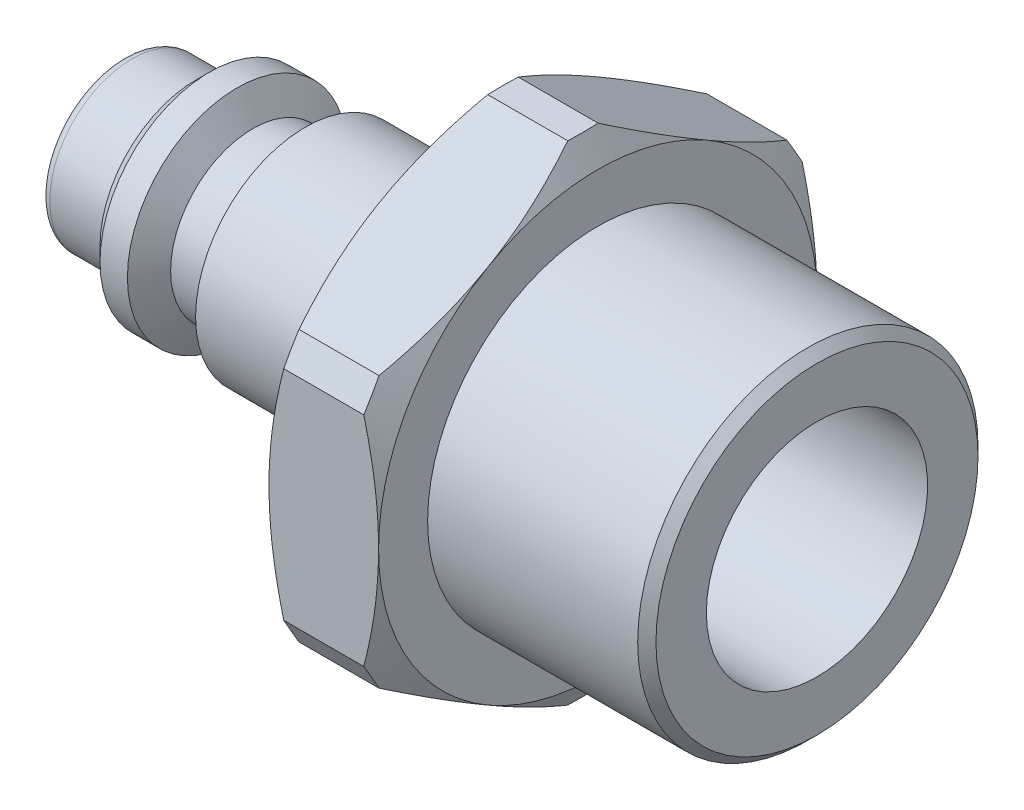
ISO-10303-21;
HEADER;
FILE_DESCRIPTION(('STEP AP214'),'2;1');
FILE_NAME('part.step','',(''),(''),'','','');
FILE_SCHEMA(('AUTOMOTIVE_DESIGN { 1 0 10303 214 1 1 1 1 }'));
ENDSEC;
DATA;
#1=APPLICATION_CONTEXT('core data for automotive mechanical design processes');
#2=APPLICATION_PROTOCOL_DEFINITION('international standard','automotive_design',2000,#1);
#3=PRODUCT_CONTEXT('',#1,'mechanical');
#4=PRODUCT('Part','Part','',(#3));
#5=PRODUCT_RELATED_PRODUCT_CATEGORY('part','',(#4));
#6=PRODUCT_DEFINITION_FORMATION('','',#4);
#7=PRODUCT_DEFINITION_CONTEXT('part definition',#1,'design');
#8=PRODUCT_DEFINITION('design','',#6,#7);
#9=PRODUCT_DEFINITION_SHAPE('','',#8);
#10=(LENGTH_UNIT() NAMED_UNIT(*) SI_UNIT(.MILLI.,.METRE.));
#11=(NAMED_UNIT(*) PLANE_ANGLE_UNIT() SI_UNIT($,.RADIAN.));
#12=(NAMED_UNIT(*) SI_UNIT($,.STERADIAN.) SOLID_ANGLE_UNIT());
#13=UNCERTAINTY_MEASURE_WITH_UNIT(LENGTH_MEASURE(1.E-05),#10,'distance_accuracy_value','');
#14=(GEOMETRIC_REPRESENTATION_CONTEXT(3) GLOBAL_UNCERTAINTY_ASSIGNED_CONTEXT((#13)) GLOBAL_UNIT_ASSIGNED_CONTEXT((#10,
#11,#12)) REPRESENTATION_CONTEXT('',''));
#15=CARTESIAN_POINT('',(0.,0.,0.));
#16=DIRECTION('',(0.,0.,1.));
#17=DIRECTION('',(1.,0.,0.));
#18=AXIS2_PLACEMENT_3D('',#15,#16,#17);
#19=CARTESIAN_POINT('',(0.,0.,0.));
#20=DIRECTION('',(1.,0.,0.));
#21=DIRECTION('',(0.,0.,-1.));
#22=AXIS2_PLACEMENT_3D('',#19,#20,#21);
#23=PLANE('',#22);
#24=CARTESIAN_POINT('',(0.,0.,0.));
#25=DIRECTION('',(1.,0.,0.));
#26=DIRECTION('',(0.,0.,-1.));
#27=AXIS2_PLACEMENT_3D('',#24,#25,#26);
#28=CIRCLE('',#27,4.);
#29=CARTESIAN_POINT('',(0.,0.,-4.));
#30=VERTEX_POINT('',#29);
#31=EDGE_CURVE('E293',#30,#30,#28,.F.);
#32=ORIENTED_EDGE('',*,*,#31,.T.);
#33=EDGE_LOOP('',(#32));
#34=FACE_BOUND('',#33,.T.);
#35=CARTESIAN_POINT('',(0.,0.,0.));
#36=DIRECTION('',(-1.,0.,0.));
#37=DIRECTION('',(0.,0.,1.));
#38=AXIS2_PLACEMENT_3D('',#35,#36,#37);
#39=CIRCLE('',#38,2.75);
#40=CARTESIAN_POINT('',(0.,0.,2.75));
#41=VERTEX_POINT('',#40);
#42=EDGE_CURVE('E163',#41,#41,#39,.T.);
#43=ORIENTED_EDGE('',*,*,#42,.F.);
#44=EDGE_LOOP('',(#43));
#45=FACE_BOUND('',#44,.T.);
#46=ADVANCED_FACE('F16',(#34,#45),#23,.F.);
#47=CARTESIAN_POINT('',(38.,10.5,0.));
#48=DIRECTION('',(-1.,0.,0.));
#49=DIRECTION('',(0.,0.,1.));
#50=AXIS2_PLACEMENT_3D('',#47,#48,#49);
#51=PLANE('',#50);
#52=CARTESIAN_POINT('',(38.,0.,0.));
#53=DIRECTION('',(-1.,0.,0.));
#54=DIRECTION('',(0.,0.,1.));
#55=AXIS2_PLACEMENT_3D('',#52,#53,#54);
#56=CIRCLE('',#55,8.81500000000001);
#57=CARTESIAN_POINT('',(38.,0.,8.81500000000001));
#58=VERTEX_POINT('',#57);
#59=EDGE_CURVE('E282',#58,#58,#56,.F.);
#60=ORIENTED_EDGE('',*,*,#59,.T.);
#61=EDGE_LOOP('',(#60));
#62=FACE_BOUND('',#61,.T.);
#63=CARTESIAN_POINT('',(38.,0.,0.));
#64=DIRECTION('',(-1.,0.,0.));
#65=DIRECTION('',(0.,0.,1.));
#66=AXIS2_PLACEMENT_3D('',#63,#64,#65);
#67=CIRCLE('',#66,6.05475);
#68=CARTESIAN_POINT('',(38.,0.,6.05475));
#69=VERTEX_POINT('',#68);
#70=EDGE_CURVE('E382',#69,#69,#67,.T.);
#71=ORIENTED_EDGE('',*,*,#70,.T.);
#72=EDGE_LOOP('',(#71));
#73=FACE_BOUND('',#72,.T.);
#74=ADVANCED_FACE('F315',(#62,#73),#51,.F.);
#75=CARTESIAN_POINT('',(-22.8506709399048,6.92820323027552,-12.));
#76=DIRECTION('',(0.,0.866025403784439,-0.5));
#77=DIRECTION('',(0.,0.5,0.866025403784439));
#78=AXIS2_PLACEMENT_3D('',#75,#76,#77);
#79=PLANE('',#78);
#80=DIRECTION('',(-1.,0.,0.));
#81=VECTOR('',#80,1.);
#82=CARTESIAN_POINT('',(-22.8506709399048,13.375,-0.833820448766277));
#83=LINE('',#82,#81);
#84=CARTESIAN_POINT('',(25.1911520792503,13.375,-0.833820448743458));
#85=VERTEX_POINT('',#84);
#86=CARTESIAN_POINT('',(20.8088479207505,13.375,-0.833820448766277));
#87=VERTEX_POINT('',#86);
#88=EDGE_CURVE('E264',#85,#87,#83,.T.);
#89=ORIENTED_EDGE('',*,*,#88,.F.);
#90=CARTESIAN_POINT('',(24.9281365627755,13.8565219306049,0.000199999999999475));
#91=CARTESIAN_POINT('',(25.0160503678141,13.7042251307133,-0.263585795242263));
#92=CARTESIAN_POINT('',(25.0999740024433,13.5513604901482,-0.5283551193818));
#93=CARTESIAN_POINT('',(25.2587337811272,13.244405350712,-1.06001701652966));
#94=CARTESIAN_POINT('',(25.3335669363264,13.0903144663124,-1.32691025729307));
#95=CARTESIAN_POINT('',(25.5429824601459,12.6255589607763,-2.13189040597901));
#96=CARTESIAN_POINT('',(25.6620967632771,12.3130596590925,-2.6731550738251));
#97=CARTESIAN_POINT('',(25.8017689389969,11.8454187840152,-3.483132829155));
#98=CARTESIAN_POINT('',(25.8415562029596,11.6916742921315,-3.74942610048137));
#99=CARTESIAN_POINT('',(25.9082766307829,11.3834734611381,-4.28324559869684));
#100=CARTESIAN_POINT('',(25.9352095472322,11.2290171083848,-4.55077184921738));
#101=CARTESIAN_POINT('',(25.9755314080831,10.9198468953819,-5.08627036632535));
#102=CARTESIAN_POINT('',(25.9889364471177,10.7651335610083,-5.35424172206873));
#103=CARTESIAN_POINT('',(26.0019169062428,10.4555635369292,-5.89043273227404));
#104=CARTESIAN_POINT('',(26.0014927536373,10.3007068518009,-6.15865237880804));
#105=CARTESIAN_POINT('',(25.9877799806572,10.0112020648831,-6.6600893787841));
#106=CARTESIAN_POINT('',(25.9761640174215,9.87653331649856,-6.89334249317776));
#107=CARTESIAN_POINT('',(25.9426919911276,9.60750555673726,-7.35931224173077));
#108=CARTESIAN_POINT('',(25.9208352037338,9.47314656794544,-7.59202883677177));
#109=CARTESIAN_POINT('',(25.8672625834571,9.20481134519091,-8.05679907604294));
#110=CARTESIAN_POINT('',(25.8355386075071,9.07083551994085,-8.288852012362));
#111=CARTESIAN_POINT('',(25.7627882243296,8.80351197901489,-8.75186996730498));
#112=CARTESIAN_POINT('',(25.7217611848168,8.67016430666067,-8.98283491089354));
#113=CARTESIAN_POINT('',(25.5836883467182,8.26537996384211,-9.68394195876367));
#114=CARTESIAN_POINT('',(25.4728751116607,7.99511549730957,-10.1520537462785));
#115=CARTESIAN_POINT('',(25.2213742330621,7.4586165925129,-11.0812971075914));
#116=CARTESIAN_POINT('',(25.0807456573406,7.19237528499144,-11.5424405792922));
#117=CARTESIAN_POINT('',(24.9281365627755,6.92808776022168,-12.0002));
#118=B_SPLINE_CURVE_WITH_KNOTS('',3,(#90,#91,#92,#93,#94,#95,#96,#97,#98,#99,#100,#101,#102,
#103,#104,#105,#106,#107,#108,#109,#110,#111,#112,#113,#114,#115,#116,#117),.UNSPECIFIED.,.F.,
.F.,(4,2,2,2,2,2,2,2,2,2,2,2,2,4),(0.,0.951004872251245,1.90232158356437,3.80900466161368,
4.7389455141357,5.66890426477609,6.59775529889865,7.5265776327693,8.33514643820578,
9.14377244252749,9.95306755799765,10.7624176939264,12.4167102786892,14.0677556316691),.UNSPECIFIED.);
#119=CARTESIAN_POINT('',(26.,10.3923048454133,-6.));
#120=VERTEX_POINT('',#119);
#121=EDGE_CURVE('E172',#85,#120,#118,.T.);
#122=ORIENTED_EDGE('',*,*,#121,.T.);
#123=CARTESIAN_POINT('',(25.1911520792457,7.40960969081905,-11.1661795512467));
#124=VERTEX_POINT('',#123);
#125=EDGE_CURVE('E169',#120,#124,#118,.T.);
#126=ORIENTED_EDGE('',*,*,#125,.T.);
#127=DIRECTION('',(1.,0.,0.));
#128=VECTOR('',#127,1.);
#129=CARTESIAN_POINT('',(-22.8506709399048,7.40960969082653,-11.1661795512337));
#130=LINE('',#129,#128);
#131=CARTESIAN_POINT('',(20.8088479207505,7.40960969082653,-11.1661795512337));
#132=VERTEX_POINT('',#131);
#133=EDGE_CURVE('E146',#132,#124,#130,.T.);
#134=ORIENTED_EDGE('',*,*,#133,.F.);
#135=CARTESIAN_POINT('',(21.0718634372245,6.92808776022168,-12.0002));
#136=CARTESIAN_POINT('',(20.9839496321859,7.0803845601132,-11.7364142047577));
#137=CARTESIAN_POINT('',(20.9000259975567,7.23324920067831,-11.4716448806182));
#138=CARTESIAN_POINT('',(20.7412662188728,7.5402043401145,-10.9399829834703));
#139=CARTESIAN_POINT('',(20.6664330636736,7.69429522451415,-10.6730897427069));
#140=CARTESIAN_POINT('',(20.4570175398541,8.15905073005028,-9.86810959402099));
#141=CARTESIAN_POINT('',(20.3379032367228,8.47155003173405,-9.3268449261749));
#142=CARTESIAN_POINT('',(20.1982310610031,8.93919090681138,-8.51686717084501));
#143=CARTESIAN_POINT('',(20.1584437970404,9.09293539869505,-8.25057389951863));
#144=CARTESIAN_POINT('',(20.0917233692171,9.40113622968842,-7.71675440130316));
#145=CARTESIAN_POINT('',(20.0647904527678,9.55559258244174,-7.44922815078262));
#146=CARTESIAN_POINT('',(20.0244685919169,9.86476279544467,-6.91372963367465));
#147=CARTESIAN_POINT('',(20.0110635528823,10.0194761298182,-6.64575827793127));
#148=CARTESIAN_POINT('',(19.9980830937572,10.3290461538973,-6.10956726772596));
#149=CARTESIAN_POINT('',(19.9985072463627,10.4839028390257,-5.84134762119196));
#150=CARTESIAN_POINT('',(20.0122200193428,10.7734076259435,-5.3399106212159));
#151=CARTESIAN_POINT('',(20.0238359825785,10.908076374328,-5.10665750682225));
#152=CARTESIAN_POINT('',(20.0573080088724,11.1771041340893,-4.64068775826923));
#153=CARTESIAN_POINT('',(20.0791647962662,11.3114631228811,-4.40797116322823));
#154=CARTESIAN_POINT('',(20.1327374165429,11.5797983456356,-3.94320092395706));
#155=CARTESIAN_POINT('',(20.1644613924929,11.7137741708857,-3.711147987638));
#156=CARTESIAN_POINT('',(20.2372117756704,11.9810977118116,-3.24813003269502));
#157=CARTESIAN_POINT('',(20.2782388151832,12.1144453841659,-3.01716508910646));
#158=CARTESIAN_POINT('',(20.4163116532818,12.5192297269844,-2.31605804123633));
#159=CARTESIAN_POINT('',(20.5271248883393,12.789494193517,-1.84794625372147));
#160=CARTESIAN_POINT('',(20.7786257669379,13.3259930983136,-0.91870289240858));
#161=CARTESIAN_POINT('',(20.9192543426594,13.5922344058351,-0.457559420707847));
#162=CARTESIAN_POINT('',(21.0718634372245,13.8565219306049,0.000199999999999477));
#163=B_SPLINE_CURVE_WITH_KNOTS('',3,(#135,#136,#137,#138,#139,#140,#141,#142,#143,#144,#145,
#146,#147,#148,#149,#150,#151,#152,#153,#154,#155,#156,#157,#158,#159,#160,#161,#162),
.UNSPECIFIED.,.F.,.F.,(4,2,2,2,2,2,2,2,2,2,2,2,2,4),(0.,0.951004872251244,1.90232158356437,
3.80900466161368,4.7389455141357,5.66890426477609,6.59775529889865,7.5265776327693,
8.33514643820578,9.14377244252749,9.95306755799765,10.7624176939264,12.4167102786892,
14.0677556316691),.UNSPECIFIED.);
#164=CARTESIAN_POINT('',(20.,10.3923048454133,-6.));
#165=VERTEX_POINT('',#164);
#166=EDGE_CURVE('E479',#132,#165,#163,.T.);
#167=ORIENTED_EDGE('',*,*,#166,.T.);
#168=EDGE_CURVE('E475',#165,#87,#163,.T.);
#169=ORIENTED_EDGE('',*,*,#168,.T.);
#170=EDGE_LOOP('',(#89,#122,#126,#134,#167,#169));
#171=FACE_BOUND('',#170,.T.);
#172=ADVANCED_FACE('F199',(#171),#79,.T.);
#173=CARTESIAN_POINT('',(-22.8506709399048,-6.92820323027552,-12.));
#174=DIRECTION('',(0.,0.,-1.));
#175=DIRECTION('',(0.,1.,0.));
#176=AXIS2_PLACEMENT_3D('',#173,#174,#175);
#177=PLANE('',#176);
#178=DIRECTION('',(1.,0.,0.));
#179=VECTOR('',#178,1.);
#180=CARTESIAN_POINT('',(-22.8506709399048,-5.96539030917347,-12.));
#181=LINE('',#180,#179);
#182=CARTESIAN_POINT('',(20.8088479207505,-5.96539030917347,-12.));
#183=VERTEX_POINT('',#182);
#184=CARTESIAN_POINT('',(25.1911520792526,-5.96539030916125,-12.));
#185=VERTEX_POINT('',#184);
#186=EDGE_CURVE('E906',#183,#185,#181,.T.);
#187=ORIENTED_EDGE('',*,*,#186,.F.);
#188=CARTESIAN_POINT('',(25.7423204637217,-18.3746159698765,-12.));
#189=CARTESIAN_POINT('',(25.6149851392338,-18.1111918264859,-12.));
#190=CARTESIAN_POINT('',(25.4883088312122,-17.8474492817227,-12.));
#191=CARTESIAN_POINT('',(25.2364255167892,-17.3192601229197,-12.));
#192=CARTESIAN_POINT('',(25.1112185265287,-17.0548135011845,-12.));
#193=CARTESIAN_POINT('',(24.7379921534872,-16.2602391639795,-12.));
#194=CARTESIAN_POINT('',(24.4924088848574,-15.7289626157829,-12.));
#195=CARTESIAN_POINT('',(24.007918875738,-14.659698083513,-12.));
#196=CARTESIAN_POINT('',(23.7690583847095,-14.1216890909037,-12.));
#197=CARTESIAN_POINT('',(23.3015929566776,-13.0412497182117,-12.));
#198=CARTESIAN_POINT('',(23.0729874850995,-12.4988195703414,-12.));
#199=CARTESIAN_POINT('',(22.6260516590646,-11.4019415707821,-12.));
#200=CARTESIAN_POINT('',(22.407881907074,-10.8474279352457,-12.));
#201=CARTESIAN_POINT('',(21.9886286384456,-9.73185625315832,-12.));
#202=CARTESIAN_POINT('',(21.7875470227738,-9.17079748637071,-12.));
#203=CARTESIAN_POINT('',(21.4078757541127,-8.04241377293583,-12.));
#204=CARTESIAN_POINT('',(21.2292382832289,-7.47510504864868,-12.));
#205=CARTESIAN_POINT('',(20.9002480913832,-6.3323679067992,-12.));
#206=CARTESIAN_POINT('',(20.7498864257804,-5.75694211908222,-12.));
#207=CARTESIAN_POINT('',(20.5510550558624,-4.88760620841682,-12.));
#208=CARTESIAN_POINT('',(20.4892196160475,-4.59673300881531,-12.));
#209=CARTESIAN_POINT('',(20.375428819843,-4.01305048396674,-12.));
#210=CARTESIAN_POINT('',(20.3234732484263,-3.72024120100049,-12.));
#211=CARTESIAN_POINT('',(20.2303623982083,-3.13287727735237,-12.));
#212=CARTESIAN_POINT('',(20.1892080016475,-2.83832249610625,-12.));
#213=CARTESIAN_POINT('',(20.1185289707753,-2.24782315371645,-12.));
#214=CARTESIAN_POINT('',(20.0890038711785,-1.95187864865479,-12.));
#215=CARTESIAN_POINT('',(20.0423753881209,-1.36089234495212,-12.));
#216=CARTESIAN_POINT('',(20.0251945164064,-1.06585670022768,-12.));
#217=CARTESIAN_POINT('',(20.0033457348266,-0.475323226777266,-12.));
#218=CARTESIAN_POINT('',(19.9986776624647,-0.179825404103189,-12.));
#219=CARTESIAN_POINT('',(20.0019652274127,0.411018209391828,-12.));
#220=CARTESIAN_POINT('',(20.0099173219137,0.706364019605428,-12.));
#221=CARTESIAN_POINT('',(20.0382476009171,1.29646300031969,-12.));
#222=CARTESIAN_POINT('',(20.0586264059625,1.59121614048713,-12.));
#223=CARTESIAN_POINT('',(20.1226527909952,2.30560702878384,-12.));
#224=CARTESIAN_POINT('',(20.1725265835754,2.72469590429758,-12.));
#225=CARTESIAN_POINT('',(20.2946274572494,3.55966217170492,-12.));
#226=CARTESIAN_POINT('',(20.3668606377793,3.97553865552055,-12.));
#227=CARTESIAN_POINT('',(20.5311184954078,4.8037371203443,-12.));
#228=CARTESIAN_POINT('',(20.6231618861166,5.21605535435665,-12.));
#229=CARTESIAN_POINT('',(20.8242314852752,6.03644960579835,-12.));
#230=CARTESIAN_POINT('',(20.933256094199,6.44452601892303,-12.));
#231=CARTESIAN_POINT('',(21.1685309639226,7.26648771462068,-12.));
#232=CARTESIAN_POINT('',(21.2951379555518,7.68027019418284,-12.));
#233=CARTESIAN_POINT('',(21.5608576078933,8.50346065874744,-12.));
#234=CARTESIAN_POINT('',(21.6999616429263,8.9128714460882,-12.));
#235=CARTESIAN_POINT('',(21.9878197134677,9.72567950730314,-12.));
#236=CARTESIAN_POINT('',(22.1365150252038,10.1290976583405,-12.));
#237=CARTESIAN_POINT('',(22.3660506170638,10.7318330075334,-12.));
#238=CARTESIAN_POINT('',(22.4436619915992,10.9323890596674,-12.));
#239=CARTESIAN_POINT('',(22.6008585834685,11.3327210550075,-12.));
#240=CARTESIAN_POINT('',(22.6804437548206,11.5324970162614,-12.));
#241=CARTESIAN_POINT('',(22.7609270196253,11.7319109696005,-12.));
#242=B_SPLINE_CURVE_WITH_KNOTS('',3,(#188,#189,#190,#191,#192,#193,#194,#195,#196,#197,#198,
#199,#200,#201,#202,#203,#204,#205,#206,#207,#208,#209,#210,#211,#212,#213,#214,#215,#216,#217,
#218,#219,#220,#221,#222,#223,#224,#225,#226,#227,#228,#229,#230,#231,#232,#233,#234,#235,#236,
#237,#238,#239,#240,#241),.UNSPECIFIED.,.F.,.F.,(4,2,2,2,2,2,2,2,2,2,2,2,2,2,2,2,2,2,2,2,2,2,2,
2,2,2,4),(0.,0.877756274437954,1.75552218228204,3.51133949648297,5.2772046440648,
7.04297763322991,8.83042883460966,10.6180786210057,12.4018527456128,14.1850616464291,
15.077040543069,15.9690000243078,16.8610323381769,17.7530289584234,18.63937614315,
19.5257118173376,20.4117987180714,21.2979298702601,22.5633628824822,23.8291413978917,
25.0961209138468,26.3629811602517,27.6608948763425,28.9579195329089,30.2476436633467,
30.8927835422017,31.5379084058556),.UNSPECIFIED.);
#243=CARTESIAN_POINT('',(20.,0.,-12.));
#244=VERTEX_POINT('',#243);
#245=EDGE_CURVE('E210',#183,#244,#242,.T.);
#246=ORIENTED_EDGE('',*,*,#245,.T.);
#247=CARTESIAN_POINT('',(20.8088479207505,5.96539030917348,-12.));
#248=VERTEX_POINT('',#247);
#249=EDGE_CURVE('E162',#244,#248,#242,.T.);
#250=ORIENTED_EDGE('',*,*,#249,.T.);
#251=DIRECTION('',(-1.,0.,0.));
#252=VECTOR('',#251,1.);
#253=CARTESIAN_POINT('',(-22.8506709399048,5.96539030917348,-12.));
#254=LINE('',#253,#252);
#255=CARTESIAN_POINT('',(25.1911520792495,5.96539030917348,-12.));
#256=VERTEX_POINT('',#255);
#257=EDGE_CURVE('E143',#256,#248,#254,.T.);
#258=ORIENTED_EDGE('',*,*,#257,.F.);
#259=CARTESIAN_POINT('',(20.2576795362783,-18.3746159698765,-12.));
#260=CARTESIAN_POINT('',(20.3850148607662,-18.1111918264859,-12.));
#261=CARTESIAN_POINT('',(20.5116911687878,-17.8474492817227,-12.));
#262=CARTESIAN_POINT('',(20.7635744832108,-17.3192601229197,-12.));
#263=CARTESIAN_POINT('',(20.8887814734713,-17.0548135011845,-12.));
#264=CARTESIAN_POINT('',(21.2620078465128,-16.2602391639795,-12.));
#265=CARTESIAN_POINT('',(21.5075911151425,-15.7289626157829,-12.));
#266=CARTESIAN_POINT('',(21.992081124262,-14.659698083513,-12.));
#267=CARTESIAN_POINT('',(22.2309416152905,-14.1216890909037,-12.));
#268=CARTESIAN_POINT('',(22.6984070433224,-13.0412497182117,-12.));
#269=CARTESIAN_POINT('',(22.9270125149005,-12.4988195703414,-12.));
#270=CARTESIAN_POINT('',(23.3739483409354,-11.4019415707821,-12.));
#271=CARTESIAN_POINT('',(23.592118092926,-10.8474279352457,-12.));
#272=CARTESIAN_POINT('',(24.0113713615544,-9.73185625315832,-12.));
#273=CARTESIAN_POINT('',(24.2124529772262,-9.17079748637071,-12.));
#274=CARTESIAN_POINT('',(24.5921242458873,-8.04241377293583,-12.));
#275=CARTESIAN_POINT('',(24.7707617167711,-7.47510504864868,-12.));
#276=CARTESIAN_POINT('',(25.0997519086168,-6.3323679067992,-12.));
#277=CARTESIAN_POINT('',(25.2501135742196,-5.75694211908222,-12.));
#278=CARTESIAN_POINT('',(25.4489449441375,-4.88760620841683,-12.));
#279=CARTESIAN_POINT('',(25.5107803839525,-4.59673300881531,-12.));
#280=CARTESIAN_POINT('',(25.624571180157,-4.01305048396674,-12.));
#281=CARTESIAN_POINT('',(25.6765267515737,-3.72024120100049,-12.));
#282=CARTESIAN_POINT('',(25.7696376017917,-3.13287727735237,-12.));
#283=CARTESIAN_POINT('',(25.8107919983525,-2.83832249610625,-12.));
#284=CARTESIAN_POINT('',(25.8814710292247,-2.24782315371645,-12.));
#285=CARTESIAN_POINT('',(25.9109961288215,-1.95187864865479,-12.));
#286=CARTESIAN_POINT('',(25.9576246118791,-1.36089234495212,-12.));
#287=CARTESIAN_POINT('',(25.9748054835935,-1.06585670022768,-12.));
#288=CARTESIAN_POINT('',(25.9966542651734,-0.475323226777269,-12.));
#289=CARTESIAN_POINT('',(26.0013223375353,-0.179825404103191,-12.));
#290=CARTESIAN_POINT('',(25.9980347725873,0.411018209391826,-12.));
#291=CARTESIAN_POINT('',(25.9900826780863,0.706364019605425,-12.));
#292=CARTESIAN_POINT('',(25.9617523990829,1.29646300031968,-12.));
#293=CARTESIAN_POINT('',(25.9413735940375,1.59121614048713,-12.));
#294=CARTESIAN_POINT('',(25.8773472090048,2.30560702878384,-12.));
#295=CARTESIAN_POINT('',(25.8274734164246,2.72469590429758,-12.));
#296=CARTESIAN_POINT('',(25.7053725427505,3.55966217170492,-12.));
#297=CARTESIAN_POINT('',(25.6331393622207,3.97553865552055,-12.));
#298=CARTESIAN_POINT('',(25.4688815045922,4.80373712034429,-12.));
#299=CARTESIAN_POINT('',(25.3768381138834,5.21605535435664,-12.));
#300=CARTESIAN_POINT('',(25.1757685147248,6.03644960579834,-12.));
#301=CARTESIAN_POINT('',(25.066743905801,6.44452601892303,-12.));
#302=CARTESIAN_POINT('',(24.8314690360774,7.26648771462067,-12.));
#303=CARTESIAN_POINT('',(24.7048620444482,7.68027019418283,-12.));
#304=CARTESIAN_POINT('',(24.4391423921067,8.50346065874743,-12.));
#305=CARTESIAN_POINT('',(24.3000383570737,8.9128714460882,-12.));
#306=CARTESIAN_POINT('',(24.0121802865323,9.72567950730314,-12.));
#307=CARTESIAN_POINT('',(23.8634849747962,10.1290976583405,-12.));
#308=CARTESIAN_POINT('',(23.6339493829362,10.7318330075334,-12.));
#309=CARTESIAN_POINT('',(23.5563380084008,10.9323890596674,-12.));
#310=CARTESIAN_POINT('',(23.3991414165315,11.3327210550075,-12.));
#311=CARTESIAN_POINT('',(23.3195562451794,11.5324970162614,-12.));
#312=CARTESIAN_POINT('',(23.2390729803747,11.7319109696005,-12.));
#313=B_SPLINE_CURVE_WITH_KNOTS('',3,(#259,#260,#261,#262,#263,#264,#265,#266,#267,#268,#269,
#270,#271,#272,#273,#274,#275,#276,#277,#278,#279,#280,#281,#282,#283,#284,#285,#286,#287,#288,
#289,#290,#291,#292,#293,#294,#295,#296,#297,#298,#299,#300,#301,#302,#303,#304,#305,#306,#307,
#308,#309,#310,#311,#312),.UNSPECIFIED.,.F.,.F.,(4,2,2,2,2,2,2,2,2,2,2,2,2,2,2,2,2,2,2,2,2,2,2,
2,2,2,4),(0.,0.877756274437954,1.75552218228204,3.51133949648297,5.2772046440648,
7.04297763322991,8.83042883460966,10.6180786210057,12.4018527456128,14.1850616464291,
15.077040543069,15.9690000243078,16.8610323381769,17.7530289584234,18.6393761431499,
19.5257118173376,20.4117987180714,21.2979298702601,22.5633628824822,23.8291413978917,
25.0961209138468,26.3629811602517,27.6608948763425,28.9579195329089,30.2476436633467,
30.8927835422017,31.5379084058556),.UNSPECIFIED.);
#314=CARTESIAN_POINT('',(26.,0.,-12.));
#315=VERTEX_POINT('',#314);
#316=EDGE_CURVE('E159',#256,#315,#313,.F.);
#317=ORIENTED_EDGE('',*,*,#316,.T.);
#318=EDGE_CURVE('E170',#315,#185,#313,.F.);
#319=ORIENTED_EDGE('',*,*,#318,.T.);
#320=EDGE_LOOP('',(#187,#246,#250,#258,#317,#319));
#321=FACE_BOUND('',#320,.T.);
#322=ADVANCED_FACE('F157',(#321),#177,.T.);
#323=CARTESIAN_POINT('',(-22.8506709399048,-13.856406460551,0.));
#324=DIRECTION('',(0.,-0.866025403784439,-0.5));
#325=DIRECTION('',(0.,0.5,-0.866025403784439));
#326=AXIS2_PLACEMENT_3D('',#323,#324,#325);
#327=PLANE('',#326);
#328=DIRECTION('',(1.,0.,0.));
#329=VECTOR('',#328,1.);
#330=CARTESIAN_POINT('',(-22.8506709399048,-13.375,-0.833820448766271));
#331=LINE('',#330,#329);
#332=CARTESIAN_POINT('',(20.8088479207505,-13.375,-0.833820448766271));
#333=VERTEX_POINT('',#332);
#334=CARTESIAN_POINT('',(25.1911520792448,-13.3750000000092,-0.833820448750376));
#335=VERTEX_POINT('',#334);
#336=EDGE_CURVE('E449',#333,#335,#331,.T.);
#337=ORIENTED_EDGE('',*,*,#336,.F.);
#338=CARTESIAN_POINT('',(21.0718634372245,-13.8565219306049,0.000200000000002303));
#339=CARTESIAN_POINT('',(20.9839496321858,-13.7042251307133,-0.263585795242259));
#340=CARTESIAN_POINT('',(20.9000259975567,-13.5513604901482,-0.528355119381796));
#341=CARTESIAN_POINT('',(20.7412662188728,-13.244405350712,-1.06001701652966));
#342=CARTESIAN_POINT('',(20.6664330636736,-13.0903144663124,-1.32691025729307));
#343=CARTESIAN_POINT('',(20.4570175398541,-12.6255589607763,-2.13189040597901));
#344=CARTESIAN_POINT('',(20.3379032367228,-12.3130596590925,-2.6731550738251));
#345=CARTESIAN_POINT('',(20.1982310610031,-11.8454187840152,-3.48313282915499));
#346=CARTESIAN_POINT('',(20.1584437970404,-11.6916742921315,-3.74942610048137));
#347=CARTESIAN_POINT('',(20.0917233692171,-11.3834734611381,-4.28324559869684));
#348=CARTESIAN_POINT('',(20.0647904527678,-11.2290171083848,-4.55077184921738));
#349=CARTESIAN_POINT('',(20.0244685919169,-10.9198468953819,-5.08627036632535));
#350=CARTESIAN_POINT('',(20.0110635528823,-10.7651335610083,-5.35424172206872));
#351=CARTESIAN_POINT('',(19.9980830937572,-10.4555635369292,-5.89043273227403));
#352=CARTESIAN_POINT('',(19.9985072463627,-10.3007068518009,-6.15865237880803));
#353=CARTESIAN_POINT('',(20.0122200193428,-10.0112020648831,-6.6600893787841));
#354=CARTESIAN_POINT('',(20.0238359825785,-9.87653331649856,-6.89334249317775));
#355=CARTESIAN_POINT('',(20.0573080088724,-9.60750555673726,-7.35931224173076));
#356=CARTESIAN_POINT('',(20.0791647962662,-9.47314656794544,-7.59202883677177));
#357=CARTESIAN_POINT('',(20.1327374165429,-9.2048113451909,-8.05679907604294));
#358=CARTESIAN_POINT('',(20.1644613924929,-9.07083551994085,-8.288852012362));
#359=CARTESIAN_POINT('',(20.2372117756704,-8.80351197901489,-8.75186996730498));
#360=CARTESIAN_POINT('',(20.2782388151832,-8.67016430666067,-8.98283491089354));
#361=CARTESIAN_POINT('',(20.4163116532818,-8.26537996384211,-9.68394195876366));
#362=CARTESIAN_POINT('',(20.5271248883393,-7.99511549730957,-10.1520537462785));
#363=CARTESIAN_POINT('',(20.7786257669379,-7.4586165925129,-11.0812971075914));
#364=CARTESIAN_POINT('',(20.9192543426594,-7.19237528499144,-11.5424405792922));
#365=CARTESIAN_POINT('',(21.0718634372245,-6.92808776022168,-12.0002));
#366=B_SPLINE_CURVE_WITH_KNOTS('',3,(#338,#339,#340,#341,#342,#343,#344,#345,#346,#347,#348,
#349,#350,#351,#352,#353,#354,#355,#356,#357,#358,#359,#360,#361,#362,#363,#364,#365),
.UNSPECIFIED.,.F.,.F.,(4,2,2,2,2,2,2,2,2,2,2,2,2,4),(0.,0.951004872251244,1.90232158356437,
3.80900466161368,4.7389455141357,5.66890426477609,6.59775529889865,7.5265776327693,
8.33514643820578,9.14377244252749,9.95306755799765,10.7624176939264,12.4167102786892,
14.0677556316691),.UNSPECIFIED.);
#367=CARTESIAN_POINT('',(20.,-10.3923048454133,-6.));
#368=VERTEX_POINT('',#367);
#369=EDGE_CURVE('E218',#333,#368,#366,.T.);
#370=ORIENTED_EDGE('',*,*,#369,.T.);
#371=CARTESIAN_POINT('',(20.8088479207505,-7.40960969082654,-11.1661795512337));
#372=VERTEX_POINT('',#371);
#373=EDGE_CURVE('E212',#368,#372,#366,.T.);
#374=ORIENTED_EDGE('',*,*,#373,.T.);
#375=DIRECTION('',(-1.,0.,0.));
#376=VECTOR('',#375,1.);
#377=CARTESIAN_POINT('',(-22.8506709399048,-7.40960969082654,-11.1661795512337));
#378=LINE('',#377,#376);
#379=CARTESIAN_POINT('',(25.1911520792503,-7.40960969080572,-11.1661795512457));
#380=VERTEX_POINT('',#379);
#381=EDGE_CURVE('E401',#380,#372,#378,.T.);
#382=ORIENTED_EDGE('',*,*,#381,.F.);
#383=CARTESIAN_POINT('',(24.9281365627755,-6.92808776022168,-12.0002));
#384=CARTESIAN_POINT('',(25.0160503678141,-7.0803845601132,-11.7364142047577));
#385=CARTESIAN_POINT('',(25.0999740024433,-7.23324920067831,-11.4716448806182));
#386=CARTESIAN_POINT('',(25.2587337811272,-7.5402043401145,-10.9399829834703));
#387=CARTESIAN_POINT('',(25.3335669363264,-7.69429522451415,-10.6730897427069));
#388=CARTESIAN_POINT('',(25.5429824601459,-8.15905073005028,-9.86810959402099));
#389=CARTESIAN_POINT('',(25.6620967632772,-8.47155003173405,-9.3268449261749));
#390=CARTESIAN_POINT('',(25.8017689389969,-8.93919090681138,-8.516867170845));
#391=CARTESIAN_POINT('',(25.8415562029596,-9.09293539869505,-8.25057389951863));
#392=CARTESIAN_POINT('',(25.9082766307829,-9.40113622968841,-7.71675440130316));
#393=CARTESIAN_POINT('',(25.9352095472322,-9.55559258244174,-7.44922815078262));
#394=CARTESIAN_POINT('',(25.9755314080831,-9.86476279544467,-6.91372963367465));
#395=CARTESIAN_POINT('',(25.9889364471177,-10.0194761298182,-6.64575827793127));
#396=CARTESIAN_POINT('',(26.0019169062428,-10.3290461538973,-6.10956726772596));
#397=CARTESIAN_POINT('',(26.0014927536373,-10.4839028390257,-5.84134762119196));
#398=CARTESIAN_POINT('',(25.9877799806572,-10.7734076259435,-5.3399106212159));
#399=CARTESIAN_POINT('',(25.9761640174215,-10.908076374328,-5.10665750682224));
#400=CARTESIAN_POINT('',(25.9426919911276,-11.1771041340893,-4.64068775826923));
#401=CARTESIAN_POINT('',(25.9208352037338,-11.3114631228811,-4.40797116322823));
#402=CARTESIAN_POINT('',(25.8672625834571,-11.5797983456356,-3.94320092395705));
#403=CARTESIAN_POINT('',(25.8355386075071,-11.7137741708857,-3.711147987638));
#404=CARTESIAN_POINT('',(25.7627882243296,-11.9810977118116,-3.24813003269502));
#405=CARTESIAN_POINT('',(25.7217611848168,-12.1144453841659,-3.01716508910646));
#406=CARTESIAN_POINT('',(25.5836883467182,-12.5192297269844,-2.31605804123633));
#407=CARTESIAN_POINT('',(25.4728751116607,-12.789494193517,-1.84794625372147));
#408=CARTESIAN_POINT('',(25.2213742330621,-13.3259930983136,-0.918702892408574));
#409=CARTESIAN_POINT('',(25.0807456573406,-13.5922344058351,-0.457559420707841));
#410=CARTESIAN_POINT('',(24.9281365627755,-13.8565219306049,0.000200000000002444));
#411=B_SPLINE_CURVE_WITH_KNOTS('',3,(#383,#384,#385,#386,#387,#388,#389,#390,#391,#392,#393,
#394,#395,#396,#397,#398,#399,#400,#401,#402,#403,#404,#405,#406,#407,#408,#409,#410),
.UNSPECIFIED.,.F.,.F.,(4,2,2,2,2,2,2,2,2,2,2,2,2,4),(0.,0.951004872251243,1.90232158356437,
3.80900466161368,4.7389455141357,5.66890426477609,6.59775529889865,7.5265776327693,
8.33514643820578,9.14377244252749,9.95306755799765,10.7624176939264,12.4167102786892,
14.0677556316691),.UNSPECIFIED.);
#412=CARTESIAN_POINT('',(26.,-10.3923048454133,-6.));
#413=VERTEX_POINT('',#412);
#414=EDGE_CURVE('E174',#380,#413,#411,.T.);
#415=ORIENTED_EDGE('',*,*,#414,.T.);
#416=EDGE_CURVE('E181',#413,#335,#411,.T.);
#417=ORIENTED_EDGE('',*,*,#416,.T.);
#418=EDGE_LOOP('',(#337,#370,#374,#382,#415,#417));
#419=FACE_BOUND('',#418,.T.);
#420=ADVANCED_FACE('F198',(#419),#327,.T.);
#421=CARTESIAN_POINT('',(-22.8506709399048,-6.92820323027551,12.));
#422=DIRECTION('',(0.,-0.866025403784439,0.5));
#423=DIRECTION('',(0.,-0.5,-0.866025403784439));
#424=AXIS2_PLACEMENT_3D('',#421,#422,#423);
#425=PLANE('',#424);
#426=DIRECTION('',(1.,0.,0.));
#427=VECTOR('',#426,1.);
#428=CARTESIAN_POINT('',(-22.8506709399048,-7.40960969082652,11.1661795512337));
#429=LINE('',#428,#427);
#430=CARTESIAN_POINT('',(20.8088479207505,-7.40960969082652,11.1661795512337));
#431=VERTEX_POINT('',#430);
#432=CARTESIAN_POINT('',(25.1911520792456,-7.40960969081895,11.1661795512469));
#433=VERTEX_POINT('',#432);
#434=EDGE_CURVE('E452',#431,#433,#429,.T.);
#435=ORIENTED_EDGE('',*,*,#434,.F.);
#436=CARTESIAN_POINT('',(21.0718634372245,-6.92808776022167,12.0002));
#437=CARTESIAN_POINT('',(20.9839496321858,-7.08038456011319,11.7364142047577));
#438=CARTESIAN_POINT('',(20.9000259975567,-7.23324920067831,11.4716448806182));
#439=CARTESIAN_POINT('',(20.7412662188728,-7.54020434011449,10.9399829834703));
#440=CARTESIAN_POINT('',(20.6664330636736,-7.69429522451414,10.6730897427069));
#441=CARTESIAN_POINT('',(20.4570175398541,-8.15905073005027,9.86810959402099));
#442=CARTESIAN_POINT('',(20.3379032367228,-8.47155003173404,9.32684492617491));
#443=CARTESIAN_POINT('',(20.1982310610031,-8.93919090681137,8.51686717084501));
#444=CARTESIAN_POINT('',(20.1584437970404,-9.09293539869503,8.25057389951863));
#445=CARTESIAN_POINT('',(20.0917233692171,-9.4011362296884,7.71675440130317));
#446=CARTESIAN_POINT('',(20.0647904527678,-9.55559258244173,7.44922815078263));
#447=CARTESIAN_POINT('',(20.0244685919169,-9.86476279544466,6.91372963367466));
#448=CARTESIAN_POINT('',(20.0110635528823,-10.0194761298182,6.64575827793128));
#449=CARTESIAN_POINT('',(19.9980830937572,-10.3290461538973,6.10956726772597));
#450=CARTESIAN_POINT('',(19.9985072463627,-10.4839028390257,5.84134762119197));
#451=CARTESIAN_POINT('',(20.0122200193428,-10.7734076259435,5.3399106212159));
#452=CARTESIAN_POINT('',(20.0238359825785,-10.908076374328,5.10665750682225));
#453=CARTESIAN_POINT('',(20.0573080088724,-11.1771041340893,4.64068775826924));
#454=CARTESIAN_POINT('',(20.0791647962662,-11.3114631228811,4.40797116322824));
#455=CARTESIAN_POINT('',(20.1327374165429,-11.5797983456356,3.94320092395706));
#456=CARTESIAN_POINT('',(20.1644613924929,-11.7137741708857,3.711147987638));
#457=CARTESIAN_POINT('',(20.2372117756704,-11.9810977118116,3.24813003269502));
#458=CARTESIAN_POINT('',(20.2782388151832,-12.1144453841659,3.01716508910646));
#459=CARTESIAN_POINT('',(20.4163116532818,-12.5192297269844,2.31605804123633));
#460=CARTESIAN_POINT('',(20.5271248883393,-12.789494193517,1.84794625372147));
#461=CARTESIAN_POINT('',(20.7786257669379,-13.3259930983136,0.918702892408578));
#462=CARTESIAN_POINT('',(20.9192543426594,-13.5922344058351,0.457559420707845));
#463=CARTESIAN_POINT('',(21.0718634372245,-13.8565219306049,-0.000199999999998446));
#464=B_SPLINE_CURVE_WITH_KNOTS('',3,(#436,#437,#438,#439,#440,#441,#442,#443,#444,#445,#446,
#447,#448,#449,#450,#451,#452,#453,#454,#455,#456,#457,#458,#459,#460,#461,#462,#463),
.UNSPECIFIED.,.F.,.F.,(4,2,2,2,2,2,2,2,2,2,2,2,2,4),(0.,0.951004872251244,1.90232158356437,
3.80900466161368,4.7389455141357,5.66890426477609,6.59775529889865,7.52657763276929,
8.33514643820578,9.14377244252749,9.95306755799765,10.7624176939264,12.4167102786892,
14.0677556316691),.UNSPECIFIED.);
#465=CARTESIAN_POINT('',(20.,-10.3923048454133,6.));
#466=VERTEX_POINT('',#465);
#467=EDGE_CURVE('E225',#431,#466,#464,.T.);
#468=ORIENTED_EDGE('',*,*,#467,.T.);
#469=CARTESIAN_POINT('',(20.8088479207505,-13.375,0.833820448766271));
#470=VERTEX_POINT('',#469);
#471=EDGE_CURVE('E219',#466,#470,#464,.T.);
#472=ORIENTED_EDGE('',*,*,#471,.T.);
#473=DIRECTION('',(-1.,0.,0.));
#474=VECTOR('',#473,1.);
#475=CARTESIAN_POINT('',(-22.8506709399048,-13.375,0.833820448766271));
#476=LINE('',#475,#474);
#477=CARTESIAN_POINT('',(25.1911520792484,-13.375,0.833820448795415));
#478=VERTEX_POINT('',#477);
#479=EDGE_CURVE('E897',#478,#470,#476,.T.);
#480=ORIENTED_EDGE('',*,*,#479,.F.);
#481=CARTESIAN_POINT('',(24.9281365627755,-13.8565219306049,-0.000199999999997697));
#482=CARTESIAN_POINT('',(25.0160503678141,-13.7042251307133,0.263585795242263));
#483=CARTESIAN_POINT('',(25.0999740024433,-13.5513604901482,0.528355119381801));
#484=CARTESIAN_POINT('',(25.2587337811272,-13.244405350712,1.06001701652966));
#485=CARTESIAN_POINT('',(25.3335669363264,-13.0903144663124,1.32691025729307));
#486=CARTESIAN_POINT('',(25.5429824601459,-12.6255589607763,2.13189040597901));
#487=CARTESIAN_POINT('',(25.6620967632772,-12.3130596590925,2.6731550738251));
#488=CARTESIAN_POINT('',(25.8017689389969,-11.8454187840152,3.483132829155));
#489=CARTESIAN_POINT('',(25.8415562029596,-11.6916742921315,3.74942610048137));
#490=CARTESIAN_POINT('',(25.9082766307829,-11.3834734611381,4.28324559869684));
#491=CARTESIAN_POINT('',(25.9352095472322,-11.2290171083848,4.55077184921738));
#492=CARTESIAN_POINT('',(25.9755314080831,-10.9198468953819,5.08627036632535));
#493=CARTESIAN_POINT('',(25.9889364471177,-10.7651335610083,5.35424172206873));
#494=CARTESIAN_POINT('',(26.0019169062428,-10.4555635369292,5.89043273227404));
#495=CARTESIAN_POINT('',(26.0014927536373,-10.3007068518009,6.15865237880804));
#496=CARTESIAN_POINT('',(25.9877799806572,-10.011202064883,6.6600893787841));
#497=CARTESIAN_POINT('',(25.9761640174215,-9.87653331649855,6.89334249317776));
#498=CARTESIAN_POINT('',(25.9426919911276,-9.60750555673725,7.35931224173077));
#499=CARTESIAN_POINT('',(25.9208352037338,-9.47314656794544,7.59202883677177));
#500=CARTESIAN_POINT('',(25.8672625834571,-9.2048113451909,8.05679907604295));
#501=CARTESIAN_POINT('',(25.8355386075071,-9.07083551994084,8.28885201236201));
#502=CARTESIAN_POINT('',(25.7627882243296,-8.80351197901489,8.75186996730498));
#503=CARTESIAN_POINT('',(25.7217611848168,-8.67016430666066,8.98283491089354));
#504=CARTESIAN_POINT('',(25.5836883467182,-8.2653799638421,9.68394195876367));
#505=CARTESIAN_POINT('',(25.4728751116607,-7.99511549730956,10.1520537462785));
#506=CARTESIAN_POINT('',(25.2213742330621,-7.45861659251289,11.0812971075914));
#507=CARTESIAN_POINT('',(25.0807456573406,-7.19237528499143,11.5424405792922));
#508=CARTESIAN_POINT('',(24.9281365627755,-6.92808776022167,12.0002));
#509=B_SPLINE_CURVE_WITH_KNOTS('',3,(#481,#482,#483,#484,#485,#486,#487,#488,#489,#490,#491,
#492,#493,#494,#495,#496,#497,#498,#499,#500,#501,#502,#503,#504,#505,#506,#507,#508),
.UNSPECIFIED.,.F.,.F.,(4,2,2,2,2,2,2,2,2,2,2,2,2,4),(0.,0.951004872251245,1.90232158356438,
3.80900466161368,4.7389455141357,5.66890426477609,6.59775529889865,7.5265776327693,
8.33514643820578,9.14377244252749,9.95306755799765,10.7624176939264,12.4167102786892,
14.0677556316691),.UNSPECIFIED.);
#510=CARTESIAN_POINT('',(26.,-10.3923048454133,6.));
#511=VERTEX_POINT('',#510);
#512=EDGE_CURVE('E246',#478,#511,#509,.T.);
#513=ORIENTED_EDGE('',*,*,#512,.T.);
#514=EDGE_CURVE('E240',#511,#433,#509,.T.);
#515=ORIENTED_EDGE('',*,*,#514,.T.);
#516=EDGE_LOOP('',(#435,#468,#472,#480,#513,#515));
#517=FACE_BOUND('',#516,.T.);
#518=ADVANCED_FACE('F232',(#517),#425,.T.);
#519=CARTESIAN_POINT('',(-22.8506709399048,6.92820323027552,12.));
#520=DIRECTION('',(0.,0.,1.));
#521=DIRECTION('',(1.,0.,0.));
#522=AXIS2_PLACEMENT_3D('',#519,#520,#521);
#523=PLANE('',#522);
#524=DIRECTION('',(1.,0.,0.));
#525=VECTOR('',#524,1.);
#526=CARTESIAN_POINT('',(-22.8506709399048,5.96539030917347,12.));
#527=LINE('',#526,#525);
#528=CARTESIAN_POINT('',(20.8088479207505,5.96539030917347,12.));
#529=VERTEX_POINT('',#528);
#530=CARTESIAN_POINT('',(25.1911520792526,5.96539030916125,12.));
#531=VERTEX_POINT('',#530);
#532=EDGE_CURVE('E39',#529,#531,#527,.T.);
#533=ORIENTED_EDGE('',*,*,#532,.F.);
#534=CARTESIAN_POINT('',(25.7423204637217,-18.3746159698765,12.));
#535=CARTESIAN_POINT('',(25.6149851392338,-18.1111918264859,12.));
#536=CARTESIAN_POINT('',(25.4883088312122,-17.8474492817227,12.));
#537=CARTESIAN_POINT('',(25.2364255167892,-17.3192601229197,12.));
#538=CARTESIAN_POINT('',(25.1112185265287,-17.0548135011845,12.));
#539=CARTESIAN_POINT('',(24.7379921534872,-16.2602391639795,12.));
#540=CARTESIAN_POINT('',(24.4924088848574,-15.7289626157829,12.));
#541=CARTESIAN_POINT('',(24.007918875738,-14.659698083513,12.));
#542=CARTESIAN_POINT('',(23.7690583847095,-14.1216890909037,12.));
#543=CARTESIAN_POINT('',(23.3015929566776,-13.0412497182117,12.));
#544=CARTESIAN_POINT('',(23.0729874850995,-12.4988195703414,12.));
#545=CARTESIAN_POINT('',(22.6260516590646,-11.4019415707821,12.));
#546=CARTESIAN_POINT('',(22.4078819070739,-10.8474279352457,12.));
#547=CARTESIAN_POINT('',(21.9886286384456,-9.73185625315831,12.));
#548=CARTESIAN_POINT('',(21.7875470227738,-9.1707974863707,12.));
#549=CARTESIAN_POINT('',(21.4078757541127,-8.04241377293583,12.));
#550=CARTESIAN_POINT('',(21.2292382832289,-7.47510504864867,12.));
#551=CARTESIAN_POINT('',(20.9002480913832,-6.33236790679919,12.));
#552=CARTESIAN_POINT('',(20.7498864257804,-5.75694211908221,12.));
#553=CARTESIAN_POINT('',(20.5510550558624,-4.88760620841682,12.));
#554=CARTESIAN_POINT('',(20.4892196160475,-4.5967330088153,12.));
#555=CARTESIAN_POINT('',(20.375428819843,-4.01305048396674,12.));
#556=CARTESIAN_POINT('',(20.3234732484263,-3.72024120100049,12.));
#557=CARTESIAN_POINT('',(20.2303623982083,-3.13287727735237,12.));
#558=CARTESIAN_POINT('',(20.1892080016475,-2.83832249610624,12.));
#559=CARTESIAN_POINT('',(20.1185289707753,-2.24782315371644,12.));
#560=CARTESIAN_POINT('',(20.0890038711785,-1.95187864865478,12.));
#561=CARTESIAN_POINT('',(20.0423753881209,-1.36089234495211,12.));
#562=CARTESIAN_POINT('',(20.0251945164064,-1.06585670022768,12.));
#563=CARTESIAN_POINT('',(20.0033457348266,-0.47532322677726,12.));
#564=CARTESIAN_POINT('',(19.9986776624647,-0.179825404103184,12.));
#565=CARTESIAN_POINT('',(20.0019652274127,0.411018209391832,12.));
#566=CARTESIAN_POINT('',(20.0099173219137,0.706364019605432,12.));
#567=CARTESIAN_POINT('',(20.0382476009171,1.29646300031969,12.));
#568=CARTESIAN_POINT('',(20.0586264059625,1.59121614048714,12.));
#569=CARTESIAN_POINT('',(20.1226527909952,2.30560702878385,12.));
#570=CARTESIAN_POINT('',(20.1725265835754,2.72469590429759,12.));
#571=CARTESIAN_POINT('',(20.2946274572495,3.55966217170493,12.));
#572=CARTESIAN_POINT('',(20.3668606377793,3.97553865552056,12.));
#573=CARTESIAN_POINT('',(20.5311184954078,4.80373712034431,12.));
#574=CARTESIAN_POINT('',(20.6231618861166,5.21605535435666,12.));
#575=CARTESIAN_POINT('',(20.8242314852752,6.03644960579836,12.));
#576=CARTESIAN_POINT('',(20.933256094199,6.44452601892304,12.));
#577=CARTESIAN_POINT('',(21.1685309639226,7.26648771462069,12.));
#578=CARTESIAN_POINT('',(21.2951379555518,7.68027019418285,12.));
#579=CARTESIAN_POINT('',(21.5608576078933,8.50346065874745,12.));
#580=CARTESIAN_POINT('',(21.6999616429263,8.91287144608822,12.));
#581=CARTESIAN_POINT('',(21.9878197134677,9.72567950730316,12.));
#582=CARTESIAN_POINT('',(22.1365150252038,10.1290976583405,12.));
#583=CARTESIAN_POINT('',(22.3660506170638,10.7318330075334,12.));
#584=CARTESIAN_POINT('',(22.4436619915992,10.9323890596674,12.));
#585=CARTESIAN_POINT('',(22.6008585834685,11.3327210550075,12.));
#586=CARTESIAN_POINT('',(22.6804437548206,11.5324970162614,12.));
#587=CARTESIAN_POINT('',(22.7609270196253,11.7319109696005,12.));
#588=B_SPLINE_CURVE_WITH_KNOTS('',3,(#534,#535,#536,#537,#538,#539,#540,#541,#542,#543,#544,
#545,#546,#547,#548,#549,#550,#551,#552,#553,#554,#555,#556,#557,#558,#559,#560,#561,#562,#563,
#564,#565,#566,#567,#568,#569,#570,#571,#572,#573,#574,#575,#576,#577,#578,#579,#580,#581,#582,
#583,#584,#585,#586,#587),.UNSPECIFIED.,.F.,.F.,(4,2,2,2,2,2,2,2,2,2,2,2,2,2,2,2,2,2,2,2,2,2,2,
2,2,2,4),(0.,0.877756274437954,1.75552218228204,3.51133949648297,5.2772046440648,
7.04297763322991,8.83042883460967,10.6180786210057,12.4018527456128,14.1850616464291,
15.077040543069,15.9690000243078,16.8610323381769,17.7530289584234,18.63937614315,
19.5257118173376,20.4117987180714,21.2979298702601,22.5633628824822,23.8291413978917,
25.0961209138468,26.3629811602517,27.6608948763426,28.957919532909,30.2476436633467,
30.8927835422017,31.5379084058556),.UNSPECIFIED.);
#589=CARTESIAN_POINT('',(20.,0.,12.));
#590=VERTEX_POINT('',#589);
#591=EDGE_CURVE('E502',#529,#590,#588,.F.);
#592=ORIENTED_EDGE('',*,*,#591,.T.);
#593=CARTESIAN_POINT('',(20.8088479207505,-5.96539030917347,12.));
#594=VERTEX_POINT('',#593);
#595=EDGE_CURVE('E226',#590,#594,#588,.F.);
#596=ORIENTED_EDGE('',*,*,#595,.T.);
#597=DIRECTION('',(-1.,0.,0.));
#598=VECTOR('',#597,1.);
#599=CARTESIAN_POINT('',(-22.8506709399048,-5.96539030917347,12.));
#600=LINE('',#599,#598);
#601=CARTESIAN_POINT('',(25.1911520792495,-5.96539030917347,12.));
#602=VERTEX_POINT('',#601);
#603=EDGE_CURVE('E448',#602,#594,#600,.T.);
#604=ORIENTED_EDGE('',*,*,#603,.F.);
#605=CARTESIAN_POINT('',(20.2576795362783,-18.3746159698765,12.));
#606=CARTESIAN_POINT('',(20.3850148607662,-18.1111918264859,12.));
#607=CARTESIAN_POINT('',(20.5116911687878,-17.8474492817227,12.));
#608=CARTESIAN_POINT('',(20.7635744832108,-17.3192601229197,12.));
#609=CARTESIAN_POINT('',(20.8887814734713,-17.0548135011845,12.));
#610=CARTESIAN_POINT('',(21.2620078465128,-16.2602391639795,12.));
#611=CARTESIAN_POINT('',(21.5075911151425,-15.7289626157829,12.));
#612=CARTESIAN_POINT('',(21.992081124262,-14.659698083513,12.));
#613=CARTESIAN_POINT('',(22.2309416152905,-14.1216890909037,12.));
#614=CARTESIAN_POINT('',(22.6984070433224,-13.0412497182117,12.));
#615=CARTESIAN_POINT('',(22.9270125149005,-12.4988195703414,12.));
#616=CARTESIAN_POINT('',(23.3739483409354,-11.4019415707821,12.));
#617=CARTESIAN_POINT('',(23.592118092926,-10.8474279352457,12.));
#618=CARTESIAN_POINT('',(24.0113713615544,-9.73185625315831,12.));
#619=CARTESIAN_POINT('',(24.2124529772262,-9.1707974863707,12.));
#620=CARTESIAN_POINT('',(24.5921242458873,-8.04241377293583,12.));
#621=CARTESIAN_POINT('',(24.7707617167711,-7.47510504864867,12.));
#622=CARTESIAN_POINT('',(25.0997519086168,-6.33236790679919,12.));
#623=CARTESIAN_POINT('',(25.2501135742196,-5.75694211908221,12.));
#624=CARTESIAN_POINT('',(25.4489449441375,-4.88760620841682,12.));
#625=CARTESIAN_POINT('',(25.5107803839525,-4.5967330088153,12.));
#626=CARTESIAN_POINT('',(25.624571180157,-4.01305048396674,12.));
#627=CARTESIAN_POINT('',(25.6765267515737,-3.72024120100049,12.));
#628=CARTESIAN_POINT('',(25.7696376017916,-3.13287727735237,12.));
#629=CARTESIAN_POINT('',(25.8107919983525,-2.83832249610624,12.));
#630=CARTESIAN_POINT('',(25.8814710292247,-2.24782315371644,12.));
#631=CARTESIAN_POINT('',(25.9109961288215,-1.95187864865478,12.));
#632=CARTESIAN_POINT('',(25.9576246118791,-1.36089234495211,12.));
#633=CARTESIAN_POINT('',(25.9748054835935,-1.06585670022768,12.));
#634=CARTESIAN_POINT('',(25.9966542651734,-0.475323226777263,12.));
#635=CARTESIAN_POINT('',(26.0013223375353,-0.179825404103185,12.));
#636=CARTESIAN_POINT('',(25.9980347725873,0.411018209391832,12.));
#637=CARTESIAN_POINT('',(25.9900826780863,0.706364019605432,12.));
#638=CARTESIAN_POINT('',(25.9617523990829,1.29646300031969,12.));
#639=CARTESIAN_POINT('',(25.9413735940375,1.59121614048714,12.));
#640=CARTESIAN_POINT('',(25.8773472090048,2.30560702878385,12.));
#641=CARTESIAN_POINT('',(25.8274734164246,2.72469590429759,12.));
#642=CARTESIAN_POINT('',(25.7053725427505,3.55966217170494,12.));
#643=CARTESIAN_POINT('',(25.6331393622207,3.97553865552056,12.));
#644=CARTESIAN_POINT('',(25.4688815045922,4.80373712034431,12.));
#645=CARTESIAN_POINT('',(25.3768381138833,5.21605535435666,12.));
#646=CARTESIAN_POINT('',(25.1757685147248,6.03644960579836,12.));
#647=CARTESIAN_POINT('',(25.0667439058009,6.44452601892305,12.));
#648=CARTESIAN_POINT('',(24.8314690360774,7.2664877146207,12.));
#649=CARTESIAN_POINT('',(24.7048620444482,7.68027019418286,12.));
#650=CARTESIAN_POINT('',(24.4391423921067,8.50346065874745,12.));
#651=CARTESIAN_POINT('',(24.3000383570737,8.91287144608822,12.));
#652=CARTESIAN_POINT('',(24.0121802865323,9.72567950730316,12.));
#653=CARTESIAN_POINT('',(23.8634849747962,10.1290976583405,12.));
#654=CARTESIAN_POINT('',(23.6339493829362,10.7318330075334,12.));
#655=CARTESIAN_POINT('',(23.5563380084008,10.9323890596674,12.));
#656=CARTESIAN_POINT('',(23.3991414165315,11.3327210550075,12.));
#657=CARTESIAN_POINT('',(23.3195562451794,11.5324970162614,12.));
#658=CARTESIAN_POINT('',(23.2390729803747,11.7319109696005,12.));
#659=B_SPLINE_CURVE_WITH_KNOTS('',3,(#605,#606,#607,#608,#609,#610,#611,#612,#613,#614,#615,
#616,#617,#618,#619,#620,#621,#622,#623,#624,#625,#626,#627,#628,#629,#630,#631,#632,#633,#634,
#635,#636,#637,#638,#639,#640,#641,#642,#643,#644,#645,#646,#647,#648,#649,#650,#651,#652,#653,
#654,#655,#656,#657,#658),.UNSPECIFIED.,.F.,.F.,(4,2,2,2,2,2,2,2,2,2,2,2,2,2,2,2,2,2,2,2,2,2,2,
2,2,2,4),(0.,0.877756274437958,1.75552218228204,3.51133949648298,5.27720464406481,
7.04297763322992,8.83042883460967,10.6180786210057,12.4018527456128,14.1850616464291,
15.0770405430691,15.9690000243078,16.8610323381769,17.7530289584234,18.63937614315,
19.5257118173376,20.4117987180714,21.2979298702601,22.5633628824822,23.8291413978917,
25.0961209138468,26.3629811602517,27.6608948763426,28.957919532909,30.2476436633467,
30.8927835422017,31.5379084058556),.UNSPECIFIED.);
#660=CARTESIAN_POINT('',(26.,0.,12.));
#661=VERTEX_POINT('',#660);
#662=EDGE_CURVE('E247',#602,#661,#659,.T.);
#663=ORIENTED_EDGE('',*,*,#662,.T.);
#664=EDGE_CURVE('E248',#661,#531,#659,.T.);
#665=ORIENTED_EDGE('',*,*,#664,.T.);
#666=EDGE_LOOP('',(#533,#592,#596,#604,#663,#665));
#667=FACE_BOUND('',#666,.T.);
#668=ADVANCED_FACE('F235',(#667),#523,.T.);
#669=CARTESIAN_POINT('',(-22.8506709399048,13.856406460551,0.));
#670=DIRECTION('',(0.,0.866025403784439,0.5));
#671=DIRECTION('',(0.,-0.5,0.866025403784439));
#672=AXIS2_PLACEMENT_3D('',#669,#670,#671);
#673=PLANE('',#672);
#674=DIRECTION('',(1.,0.,0.));
#675=VECTOR('',#674,1.);
#676=CARTESIAN_POINT('',(-22.8506709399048,13.375,0.833820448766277));
#677=LINE('',#676,#675);
#678=CARTESIAN_POINT('',(20.8088479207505,13.375,0.833820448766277));
#679=VERTEX_POINT('',#678);
#680=CARTESIAN_POINT('',(25.1911520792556,13.3749999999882,0.83382044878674));
#681=VERTEX_POINT('',#680);
#682=EDGE_CURVE('E31',#679,#681,#677,.T.);
#683=ORIENTED_EDGE('',*,*,#682,.F.);
#684=CARTESIAN_POINT('',(21.0718634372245,13.8565219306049,-0.000200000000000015));
#685=CARTESIAN_POINT('',(20.9839496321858,13.7042251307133,0.263585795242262));
#686=CARTESIAN_POINT('',(20.9000259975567,13.5513604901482,0.528355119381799));
#687=CARTESIAN_POINT('',(20.7412662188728,13.244405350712,1.06001701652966));
#688=CARTESIAN_POINT('',(20.6664330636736,13.0903144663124,1.32691025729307));
#689=CARTESIAN_POINT('',(20.4570175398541,12.6255589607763,2.13189040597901));
#690=CARTESIAN_POINT('',(20.3379032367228,12.3130596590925,2.6731550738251));
#691=CARTESIAN_POINT('',(20.1982310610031,11.8454187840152,3.483132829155));
#692=CARTESIAN_POINT('',(20.1584437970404,11.6916742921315,3.74942610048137));
#693=CARTESIAN_POINT('',(20.0917233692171,11.3834734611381,4.28324559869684));
#694=CARTESIAN_POINT('',(20.0647904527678,11.2290171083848,4.55077184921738));
#695=CARTESIAN_POINT('',(20.0244685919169,10.9198468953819,5.08627036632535));
#696=CARTESIAN_POINT('',(20.0110635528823,10.7651335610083,5.35424172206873));
#697=CARTESIAN_POINT('',(19.9980830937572,10.4555635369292,5.89043273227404));
#698=CARTESIAN_POINT('',(19.9985072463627,10.3007068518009,6.15865237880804));
#699=CARTESIAN_POINT('',(20.0122200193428,10.0112020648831,6.6600893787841));
#700=CARTESIAN_POINT('',(20.0238359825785,9.87653331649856,6.89334249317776));
#701=CARTESIAN_POINT('',(20.0573080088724,9.60750555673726,7.35931224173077));
#702=CARTESIAN_POINT('',(20.0791647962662,9.47314656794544,7.59202883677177));
#703=CARTESIAN_POINT('',(20.1327374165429,9.20481134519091,8.05679907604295));
#704=CARTESIAN_POINT('',(20.1644613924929,9.07083551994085,8.28885201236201));
#705=CARTESIAN_POINT('',(20.2372117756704,8.80351197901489,8.75186996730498));
#706=CARTESIAN_POINT('',(20.2782388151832,8.67016430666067,8.98283491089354));
#707=CARTESIAN_POINT('',(20.4163116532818,8.26537996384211,9.68394195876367));
#708=CARTESIAN_POINT('',(20.5271248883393,7.99511549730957,10.1520537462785));
#709=CARTESIAN_POINT('',(20.7786257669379,7.4586165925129,11.0812971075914));
#710=CARTESIAN_POINT('',(20.9192543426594,7.19237528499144,11.5424405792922));
#711=CARTESIAN_POINT('',(21.0718634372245,6.92808776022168,12.0002));
#712=B_SPLINE_CURVE_WITH_KNOTS('',3,(#684,#685,#686,#687,#688,#689,#690,#691,#692,#693,#694,
#695,#696,#697,#698,#699,#700,#701,#702,#703,#704,#705,#706,#707,#708,#709,#710,#711),
.UNSPECIFIED.,.F.,.F.,(4,2,2,2,2,2,2,2,2,2,2,2,2,4),(0.,0.951004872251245,1.90232158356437,
3.80900466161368,4.7389455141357,5.66890426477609,6.59775529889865,7.5265776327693,
8.33514643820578,9.14377244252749,9.95306755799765,10.7624176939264,12.4167102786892,
14.0677556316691),.UNSPECIFIED.);
#713=CARTESIAN_POINT('',(20.,10.3923048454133,6.));
#714=VERTEX_POINT('',#713);
#715=EDGE_CURVE('E477',#679,#714,#712,.T.);
#716=ORIENTED_EDGE('',*,*,#715,.T.);
#717=CARTESIAN_POINT('',(20.8088479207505,7.40960969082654,11.1661795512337));
#718=VERTEX_POINT('',#717);
#719=EDGE_CURVE('E496',#714,#718,#712,.T.);
#720=ORIENTED_EDGE('',*,*,#719,.T.);
#721=DIRECTION('',(-1.,0.,0.));
#722=VECTOR('',#721,1.);
#723=CARTESIAN_POINT('',(-22.8506709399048,7.40960969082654,11.1661795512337));
#724=LINE('',#723,#722);
#725=CARTESIAN_POINT('',(25.1911520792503,7.40960969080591,11.1661795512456));
#726=VERTEX_POINT('',#725);
#727=EDGE_CURVE('E459',#726,#718,#724,.T.);
#728=ORIENTED_EDGE('',*,*,#727,.F.);
#729=CARTESIAN_POINT('',(24.9281365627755,6.92808776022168,12.0002));
#730=CARTESIAN_POINT('',(25.0160503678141,7.0803845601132,11.7364142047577));
#731=CARTESIAN_POINT('',(25.0999740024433,7.23324920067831,11.4716448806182));
#732=CARTESIAN_POINT('',(25.2587337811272,7.5402043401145,10.9399829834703));
#733=CARTESIAN_POINT('',(25.3335669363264,7.69429522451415,10.6730897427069));
#734=CARTESIAN_POINT('',(25.5429824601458,8.15905073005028,9.868109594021));
#735=CARTESIAN_POINT('',(25.6620967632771,8.47155003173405,9.32684492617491));
#736=CARTESIAN_POINT('',(25.8017689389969,8.93919090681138,8.51686717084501));
#737=CARTESIAN_POINT('',(25.8415562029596,9.09293539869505,8.25057389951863));
#738=CARTESIAN_POINT('',(25.9082766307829,9.40113622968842,7.71675440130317));
#739=CARTESIAN_POINT('',(25.9352095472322,9.55559258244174,7.44922815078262));
#740=CARTESIAN_POINT('',(25.9755314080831,9.86476279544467,6.91372963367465));
#741=CARTESIAN_POINT('',(25.9889364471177,10.0194761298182,6.64575827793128));
#742=CARTESIAN_POINT('',(26.0019169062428,10.3290461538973,6.10956726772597));
#743=CARTESIAN_POINT('',(26.0014927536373,10.4839028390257,5.84134762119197));
#744=CARTESIAN_POINT('',(25.9877799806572,10.7734076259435,5.3399106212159));
#745=CARTESIAN_POINT('',(25.9761640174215,10.908076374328,5.10665750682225));
#746=CARTESIAN_POINT('',(25.9426919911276,11.1771041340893,4.64068775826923));
#747=CARTESIAN_POINT('',(25.9208352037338,11.3114631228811,4.40797116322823));
#748=CARTESIAN_POINT('',(25.8672625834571,11.5797983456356,3.94320092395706));
#749=CARTESIAN_POINT('',(25.8355386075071,11.7137741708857,3.711147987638));
#750=CARTESIAN_POINT('',(25.7627882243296,11.9810977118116,3.24813003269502));
#751=CARTESIAN_POINT('',(25.7217611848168,12.1144453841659,3.01716508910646));
#752=CARTESIAN_POINT('',(25.5836883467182,12.5192297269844,2.31605804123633));
#753=CARTESIAN_POINT('',(25.4728751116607,12.789494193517,1.84794625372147));
#754=CARTESIAN_POINT('',(25.2213742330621,13.3259930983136,0.918702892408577));
#755=CARTESIAN_POINT('',(25.0807456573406,13.5922344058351,0.457559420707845));
#756=CARTESIAN_POINT('',(24.9281365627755,13.8565219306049,-0.000200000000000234));
#757=B_SPLINE_CURVE_WITH_KNOTS('',3,(#729,#730,#731,#732,#733,#734,#735,#736,#737,#738,#739,
#740,#741,#742,#743,#744,#745,#746,#747,#748,#749,#750,#751,#752,#753,#754,#755,#756),
.UNSPECIFIED.,.F.,.F.,(4,2,2,2,2,2,2,2,2,2,2,2,2,4),(0.,0.951004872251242,1.90232158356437,
3.80900466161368,4.7389455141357,5.66890426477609,6.59775529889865,7.5265776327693,
8.33514643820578,9.14377244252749,9.95306755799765,10.7624176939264,12.4167102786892,
14.0677556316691),.UNSPECIFIED.);
#758=CARTESIAN_POINT('',(26.,10.3923048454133,6.));
#759=VERTEX_POINT('',#758);
#760=EDGE_CURVE('E152',#726,#759,#757,.T.);
#761=ORIENTED_EDGE('',*,*,#760,.T.);
#762=EDGE_CURVE('E417',#759,#681,#757,.T.);
#763=ORIENTED_EDGE('',*,*,#762,.T.);
#764=EDGE_LOOP('',(#683,#716,#720,#728,#761,#763));
#765=FACE_BOUND('',#764,.T.);
#766=ADVANCED_FACE('F361',(#765),#673,.T.);
#767=CARTESIAN_POINT('',(20.,15.,0.));
#768=DIRECTION('',(1.,0.,0.));
#769=DIRECTION('',(0.,0.,-1.));
#770=AXIS2_PLACEMENT_3D('',#767,#768,#769);
#771=PLANE('',#770);
#772=CARTESIAN_POINT('',(20.,0.,0.));
#773=DIRECTION('',(1.,0.,0.));
#774=DIRECTION('',(0.,0.,-1.));
#775=AXIS2_PLACEMENT_3D('',#772,#773,#774);
#776=CIRCLE('',#775,6.5);
#777=CARTESIAN_POINT('',(20.,0.,-6.5));
#778=VERTEX_POINT('',#777);
#779=EDGE_CURVE('E10',#778,#778,#776,.T.);
#780=ORIENTED_EDGE('',*,*,#779,.T.);
#781=EDGE_LOOP('',(#780));
#782=FACE_BOUND('',#781,.T.);
#783=CARTESIAN_POINT('',(20.,0.,0.));
#784=DIRECTION('',(-1.,0.,0.));
#785=DIRECTION('',(0.,0.,1.));
#786=AXIS2_PLACEMENT_3D('',#783,#784,#785);
#787=CIRCLE('',#786,12.);
#788=EDGE_CURVE('E544',#165,#244,#787,.T.);
#789=ORIENTED_EDGE('',*,*,#788,.T.);
#790=EDGE_CURVE('E556',#244,#368,#787,.T.);
#791=ORIENTED_EDGE('',*,*,#790,.T.);
#792=EDGE_CURVE('E555',#368,#466,#787,.T.);
#793=ORIENTED_EDGE('',*,*,#792,.T.);
#794=EDGE_CURVE('E554',#466,#590,#787,.T.);
#795=ORIENTED_EDGE('',*,*,#794,.T.);
#796=EDGE_CURVE('E211',#590,#714,#787,.T.);
#797=ORIENTED_EDGE('',*,*,#796,.T.);
#798=EDGE_CURVE('E540',#714,#165,#787,.T.);
#799=ORIENTED_EDGE('',*,*,#798,.T.);
#800=EDGE_LOOP('',(#789,#791,#793,#795,#797,#799));
#801=FACE_BOUND('',#800,.T.);
#802=ADVANCED_FACE('F358',(#782,#801),#771,.F.);
#803=CARTESIAN_POINT('',(0.,0.,0.));
#804=DIRECTION('',(-1.,0.,0.));
#805=DIRECTION('',(0.,0.,1.));
#806=AXIS2_PLACEMENT_3D('',#803,#804,#805);
#807=CYLINDRICAL_SURFACE('',#806,6.);
#808=CARTESIAN_POINT('',(19.5,0.,0.));
#809=DIRECTION('',(1.,0.,0.));
#810=DIRECTION('',(0.,0.,-1.));
#811=AXIS2_PLACEMENT_3D('',#808,#809,#810);
#812=CIRCLE('',#811,6.);
#813=CARTESIAN_POINT('',(19.5,0.,-6.));
#814=VERTEX_POINT('',#813);
#815=EDGE_CURVE('E24',#814,#814,#812,.F.);
#816=ORIENTED_EDGE('',*,*,#815,.T.);
#817=EDGE_LOOP('',(#816));
#818=FACE_BOUND('',#817,.T.);
#819=CARTESIAN_POINT('',(9.98205080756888,0.,0.));
#820=DIRECTION('',(-1.,0.,0.));
#821=DIRECTION('',(0.,0.,1.));
#822=AXIS2_PLACEMENT_3D('',#819,#820,#821);
#823=CIRCLE('',#822,6.);
#824=CARTESIAN_POINT('',(9.98205080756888,0.,6.));
#825=VERTEX_POINT('',#824);
#826=EDGE_CURVE('E481',#825,#825,#823,.T.);
#827=ORIENTED_EDGE('',*,*,#826,.F.);
#828=EDGE_LOOP('',(#827));
#829=FACE_BOUND('',#828,.T.);
#830=ADVANCED_FACE('F301',(#818,#829),#807,.T.);
#831=CARTESIAN_POINT('',(9.98205080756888,0.,0.));
#832=DIRECTION('',(1.,0.,0.));
#833=DIRECTION('',(0.,0.,-1.));
#834=AXIS2_PLACEMENT_3D('',#831,#832,#833);
#835=CONICAL_SURFACE('',#834,6.,1.0471975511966);
#836=CARTESIAN_POINT('',(9.11602540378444,0.,0.));
#837=DIRECTION('',(-1.,0.,0.));
#838=DIRECTION('',(0.,0.,1.));
#839=AXIS2_PLACEMENT_3D('',#836,#837,#838);
#840=CIRCLE('',#839,4.5);
#841=CARTESIAN_POINT('',(9.11602540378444,0.,4.5));
#842=VERTEX_POINT('',#841);
#843=EDGE_CURVE('E483',#842,#842,#840,.T.);
#844=ORIENTED_EDGE('',*,*,#843,.F.);
#845=EDGE_LOOP('',(#844));
#846=FACE_BOUND('',#845,.T.);
#847=ORIENTED_EDGE('',*,*,#826,.T.);
#848=EDGE_LOOP('',(#847));
#849=FACE_BOUND('',#848,.T.);
#850=ADVANCED_FACE('F351',(#846,#849),#835,.T.);
#851=CARTESIAN_POINT('',(0.,0.,0.));
#852=DIRECTION('',(-1.,0.,0.));
#853=DIRECTION('',(0.,0.,1.));
#854=AXIS2_PLACEMENT_3D('',#851,#852,#853);
#855=CYLINDRICAL_SURFACE('',#854,4.5);
#856=CARTESIAN_POINT('',(7.11602540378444,0.,0.));
#857=DIRECTION('',(-1.,0.,0.));
#858=DIRECTION('',(0.,0.,1.));
#859=AXIS2_PLACEMENT_3D('',#856,#857,#858);
#860=CIRCLE('',#859,4.5);
#861=CARTESIAN_POINT('',(7.11602540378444,0.,4.5));
#862=VERTEX_POINT('',#861);
#863=EDGE_CURVE('E518',#862,#862,#860,.T.);
#864=ORIENTED_EDGE('',*,*,#863,.F.);
#865=EDGE_LOOP('',(#864));
#866=FACE_BOUND('',#865,.T.);
#867=ORIENTED_EDGE('',*,*,#843,.T.);
#868=EDGE_LOOP('',(#867));
#869=FACE_BOUND('',#868,.T.);
#870=ADVANCED_FACE('F347',(#866,#869),#855,.T.);
#871=CARTESIAN_POINT('',(7.11602540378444,0.,0.));
#872=DIRECTION('',(-1.,0.,0.));
#873=DIRECTION('',(0.,0.,1.));
#874=AXIS2_PLACEMENT_3D('',#871,#872,#873);
#875=CONICAL_SURFACE('',#874,4.5,1.0471975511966);
#876=CARTESIAN_POINT('',(6.25,0.,0.));
#877=DIRECTION('',(-1.,0.,0.));
#878=DIRECTION('',(0.,0.,1.));
#879=AXIS2_PLACEMENT_3D('',#876,#877,#878);
#880=CIRCLE('',#879,6.);
#881=CARTESIAN_POINT('',(6.25,0.,6.));
#882=VERTEX_POINT('',#881);
#883=EDGE_CURVE('E515',#882,#882,#880,.T.);
#884=ORIENTED_EDGE('',*,*,#883,.F.);
#885=EDGE_LOOP('',(#884));
#886=FACE_BOUND('',#885,.T.);
#887=ORIENTED_EDGE('',*,*,#863,.T.);
#888=EDGE_LOOP('',(#887));
#889=FACE_BOUND('',#888,.T.);
#890=ADVANCED_FACE('F343',(#886,#889),#875,.T.);
#891=CARTESIAN_POINT('',(0.,0.,0.));
#892=DIRECTION('',(-1.,0.,0.));
#893=DIRECTION('',(0.,0.,1.));
#894=AXIS2_PLACEMENT_3D('',#891,#892,#893);
#895=CYLINDRICAL_SURFACE('',#894,6.);
#896=CARTESIAN_POINT('',(4.75,0.,0.));
#897=DIRECTION('',(-1.,0.,0.));
#898=DIRECTION('',(0.,0.,1.));
#899=AXIS2_PLACEMENT_3D('',#896,#897,#898);
#900=CIRCLE('',#899,6.);
#901=CARTESIAN_POINT('',(4.75,0.,6.));
#902=VERTEX_POINT('',#901);
#903=EDGE_CURVE('E512',#902,#902,#900,.T.);
#904=ORIENTED_EDGE('',*,*,#903,.F.);
#905=EDGE_LOOP('',(#904));
#906=FACE_BOUND('',#905,.T.);
#907=ORIENTED_EDGE('',*,*,#883,.T.);
#908=EDGE_LOOP('',(#907));
#909=FACE_BOUND('',#908,.T.);
#910=ADVANCED_FACE('F339',(#906,#909),#895,.T.);
#911=CARTESIAN_POINT('',(4.75,0.,0.));
#912=DIRECTION('',(1.,0.,0.));
#913=DIRECTION('',(0.,0.,-1.));
#914=AXIS2_PLACEMENT_3D('',#911,#912,#913);
#915=CONICAL_SURFACE('',#914,6.,0.785398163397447);
#916=CARTESIAN_POINT('',(4.,0.,0.));
#917=DIRECTION('',(-1.,0.,0.));
#918=DIRECTION('',(0.,0.,1.));
#919=AXIS2_PLACEMENT_3D('',#916,#917,#918);
#920=CIRCLE('',#919,5.25);
#921=CARTESIAN_POINT('',(4.,0.,5.25));
#922=VERTEX_POINT('',#921);
#923=EDGE_CURVE('E509',#922,#922,#920,.T.);
#924=ORIENTED_EDGE('',*,*,#923,.F.);
#925=EDGE_LOOP('',(#924));
#926=FACE_BOUND('',#925,.T.);
#927=ORIENTED_EDGE('',*,*,#903,.T.);
#928=EDGE_LOOP('',(#927));
#929=FACE_BOUND('',#928,.T.);
#930=ADVANCED_FACE('F335',(#926,#929),#915,.T.);
#931=CARTESIAN_POINT('',(4.,4.5,0.));
#932=DIRECTION('',(1.,0.,0.));
#933=DIRECTION('',(0.,0.,-1.));
#934=AXIS2_PLACEMENT_3D('',#931,#932,#933);
#935=PLANE('',#934);
#936=CARTESIAN_POINT('',(4.,0.,0.));
#937=DIRECTION('',(-1.,0.,0.));
#938=DIRECTION('',(0.,0.,1.));
#939=AXIS2_PLACEMENT_3D('',#936,#937,#938);
#940=CIRCLE('',#939,4.5);
#941=CARTESIAN_POINT('',(4.,0.,4.5));
#942=VERTEX_POINT('',#941);
#943=EDGE_CURVE('E506',#942,#942,#940,.T.);
#944=ORIENTED_EDGE('',*,*,#943,.F.);
#945=EDGE_LOOP('',(#944));
#946=FACE_BOUND('',#945,.T.);
#947=ORIENTED_EDGE('',*,*,#923,.T.);
#948=EDGE_LOOP('',(#947));
#949=FACE_BOUND('',#948,.T.);
#950=ADVANCED_FACE('F331',(#946,#949),#935,.F.);
#951=CARTESIAN_POINT('',(0.,0.,0.));
#952=DIRECTION('',(-1.,0.,0.));
#953=DIRECTION('',(0.,0.,1.));
#954=AXIS2_PLACEMENT_3D('',#951,#952,#953);
#955=CYLINDRICAL_SURFACE('',#954,4.5);
#956=CARTESIAN_POINT('',(0.5,0.,0.));
#957=DIRECTION('',(1.,0.,0.));
#958=DIRECTION('',(0.,0.,-1.));
#959=AXIS2_PLACEMENT_3D('',#956,#957,#958);
#960=CIRCLE('',#959,4.5);
#961=CARTESIAN_POINT('',(0.5,0.,-4.5));
#962=VERTEX_POINT('',#961);
#963=EDGE_CURVE('E296',#962,#962,#960,.T.);
#964=ORIENTED_EDGE('',*,*,#963,.T.);
#965=EDGE_LOOP('',(#964));
#966=FACE_BOUND('',#965,.T.);
#967=ORIENTED_EDGE('',*,*,#943,.T.);
#968=EDGE_LOOP('',(#967));
#969=FACE_BOUND('',#968,.T.);
#970=ADVANCED_FACE('F327',(#966,#969),#955,.T.);
#971=CARTESIAN_POINT('',(20.,0.,0.));
#972=DIRECTION('',(1.,0.,0.));
#973=DIRECTION('',(0.,0.,-1.));
#974=AXIS2_PLACEMENT_3D('',#971,#972,#973);
#975=CONICAL_SURFACE('',#974,12.,1.0471975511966);
#976=CARTESIAN_POINT('',(25.724813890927,13.375,-17.3610455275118));
#977=CARTESIAN_POINT('',(25.6054172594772,13.375,-17.0999844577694));
#978=CARTESIAN_POINT('',(25.4868450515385,13.375,-16.8385464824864));
#979=CARTESIAN_POINT('',(25.2515298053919,13.375,-16.3148440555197));
#980=CARTESIAN_POINT('',(25.1347867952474,13.375,-16.0525795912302));
#981=CARTESIAN_POINT('',(24.78752761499,13.375,-15.2643362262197));
#982=CARTESIAN_POINT('',(24.5600329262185,13.375,-14.7370198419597));
#983=CARTESIAN_POINT('',(24.1135949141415,13.375,-13.6750346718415));
#984=CARTESIAN_POINT('',(23.8947111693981,13.375,-13.1403407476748));
#985=CARTESIAN_POINT('',(23.4693547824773,13.375,-12.0660641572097));
#986=CARTESIAN_POINT('',(23.2628813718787,13.375,-11.5264817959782));
#987=CARTESIAN_POINT('',(22.8668488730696,13.375,-10.4456480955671));
#988=CARTESIAN_POINT('',(22.6771748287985,13.375,-9.90443942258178));
#989=CARTESIAN_POINT('',(22.3167891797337,13.375,-8.81578761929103));
#990=CARTESIAN_POINT('',(22.1460791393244,13.375,-8.26834397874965));
#991=CARTESIAN_POINT('',(21.6699062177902,13.375,-6.61796879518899));
#992=CARTESIAN_POINT('',(21.3992863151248,13.375,-5.50408787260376));
#993=CARTESIAN_POINT('',(21.1405850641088,13.375,-4.06384315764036));
#994=CARTESIAN_POINT('',(21.0894414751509,13.375,-3.74848274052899));
#995=CARTESIAN_POINT('',(20.9986946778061,13.375,-3.11612340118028));
#996=CARTESIAN_POINT('',(20.9590898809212,13.375,-2.79912471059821));
#997=CARTESIAN_POINT('',(20.892175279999,13.375,-2.1637719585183));
#998=CARTESIAN_POINT('',(20.86486765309,13.375,-1.845417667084));
#999=CARTESIAN_POINT('',(20.8231245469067,13.375,-1.20785748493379));
#1000=CARTESIAN_POINT('',(20.8086891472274,13.375,-0.888651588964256));
#1001=CARTESIAN_POINT('',(20.7930094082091,13.375,-0.250002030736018));
#1002=CARTESIAN_POINT('',(20.7917614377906,13.375,0.0694415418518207));
#1003=CARTESIAN_POINT('',(20.8024747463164,13.375,0.708102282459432));
#1004=CARTESIAN_POINT('',(20.8144358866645,13.375,1.02731945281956));
#1005=CARTESIAN_POINT('',(20.8512980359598,13.375,1.66489641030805));
#1006=CARTESIAN_POINT('',(20.8761948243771,13.375,1.98325644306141));
#1007=CARTESIAN_POINT('',(20.938404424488,13.375,2.61878221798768));
#1008=CARTESIAN_POINT('',(20.975718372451,13.375,2.93594784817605));
#1009=CARTESIAN_POINT('',(21.0621207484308,13.375,3.56932910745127));
#1010=CARTESIAN_POINT('',(21.1112332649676,13.375,3.88554143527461));
#1011=CARTESIAN_POINT('',(21.2203190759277,13.375,4.51609712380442));
#1012=CARTESIAN_POINT('',(21.2802932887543,13.375,4.83044032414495));
#1013=CARTESIAN_POINT('',(21.4751253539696,13.375,5.77056359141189));
#1014=CARTESIAN_POINT('',(21.6248709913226,13.375,6.39328499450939));
#1015=CARTESIAN_POINT('',(21.9569798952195,13.375,7.63226188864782));
#1016=CARTESIAN_POINT('',(22.1394624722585,13.375,8.24848469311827));
#1017=CARTESIAN_POINT('',(22.5298094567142,13.375,9.47268285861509));
#1018=CARTESIAN_POINT('',(22.7376708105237,13.375,10.0806592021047));
#1019=CARTESIAN_POINT('',(23.1766637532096,13.375,11.2988673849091));
#1020=CARTESIAN_POINT('',(23.4081089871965,13.375,11.9089852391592));
#1021=CARTESIAN_POINT('',(23.886996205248,13.375,13.1229311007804));
#1022=CARTESIAN_POINT('',(24.13443953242,13.375,13.7267585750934));
#1023=CARTESIAN_POINT('',(24.6394925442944,13.375,14.9234453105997));
#1024=CARTESIAN_POINT('',(24.8969848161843,13.375,15.5163543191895));
#1025=CARTESIAN_POINT('',(25.2905278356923,13.375,16.402347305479));
#1026=CARTESIAN_POINT('',(25.4229056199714,13.375,16.6970720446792));
#1027=CARTESIAN_POINT('',(25.6898610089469,13.375,17.2855163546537));
#1028=CARTESIAN_POINT('',(25.8244385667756,13.375,17.5792359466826));
#1029=CARTESIAN_POINT('',(25.9599954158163,13.375,17.8725031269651));
#1030=B_SPLINE_CURVE_WITH_KNOTS('',3,(#976,#977,#978,#979,#980,#981,#982,#983,#984,#985,#986,
#987,#988,#989,#990,#991,#992,#993,#994,#995,#996,#997,#998,#999,#1000,#1001,#1002,#1003,#1004,
#1005,#1006,#1007,#1008,#1009,#1010,#1011,#1012,#1013,#1014,#1015,#1016,#1017,#1018,#1019,#1020,
#1021,#1022,#1023,#1024,#1025,#1026,#1027,#1028,#1029),.UNSPECIFIED.,.F.,.F.,(4,2,2,2,2,2,2,2,2,
2,2,2,2,2,2,2,2,2,2,2,2,2,2,2,2,2,4),(0.,0.861203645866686,1.7224204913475,3.44522546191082,
5.17837956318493,6.91142624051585,8.63151108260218,10.3517377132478,13.7828749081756,
14.7411589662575,15.6993110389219,16.6576326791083,17.6159602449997,18.5740239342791,
19.5320775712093,20.4898188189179,21.4476477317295,22.4074490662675,23.3673315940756,
25.2875573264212,27.2149290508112,29.1420690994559,31.0994121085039,33.0569196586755,
34.9960286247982,35.9652887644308,36.9345282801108),.UNSPECIFIED.);
#1031=EDGE_CURVE('E259',#87,#679,#1030,.T.);
#1032=ORIENTED_EDGE('',*,*,#1031,.F.);
#1033=ORIENTED_EDGE('',*,*,#168,.F.);
#1034=ORIENTED_EDGE('',*,*,#798,.F.);
#1035=ORIENTED_EDGE('',*,*,#715,.F.);
#1036=EDGE_LOOP('',(#1032,#1033,#1034,#1035));
#1037=FACE_BOUND('',#1036,.T.);
#1038=ADVANCED_FACE('F330',(#1037),#975,.T.);
#1039=CARTESIAN_POINT('',(20.8088622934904,5.96504389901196,-12.0002));
#1040=CARTESIAN_POINT('',(20.8021598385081,6.12644562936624,-11.9070146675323));
#1041=CARTESIAN_POINT('',(20.7976996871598,6.28791177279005,-11.8137921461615));
#1042=CARTESIAN_POINT('',(20.7932760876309,6.61088939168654,-11.6273209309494));
#1043=CARTESIAN_POINT('',(20.7933126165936,6.77240086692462,-11.5340722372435));
#1044=CARTESIAN_POINT('',(20.8001749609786,7.25615171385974,-11.2547785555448));
#1045=CARTESIAN_POINT('',(20.8137232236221,7.57833663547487,-11.0687650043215));
#1046=CARTESIAN_POINT('',(20.8583802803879,8.22174560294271,-10.6972926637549));
#1047=CARTESIAN_POINT('',(20.8894871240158,8.54296975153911,-10.5118338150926));
#1048=CARTESIAN_POINT('',(20.9486872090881,9.02397860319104,-10.2341232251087));
#1049=CARTESIAN_POINT('',(20.9705424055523,9.18435804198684,-10.1415281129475));
#1050=CARTESIAN_POINT('',(21.0182840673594,9.50466022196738,-9.9566015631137));
#1051=CARTESIAN_POINT('',(21.0441703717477,9.66458298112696,-9.86427011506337));
#1052=CARTESIAN_POINT('',(21.0719967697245,9.82425490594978,-9.77208348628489));
#1053=B_SPLINE_CURVE_WITH_KNOTS('',3,(#1039,#1040,#1041,#1042,#1043,#1044,#1045,#1046,#1047,
#1048,#1049,#1050,#1051,#1052),.UNSPECIFIED.,.F.,.F.,(4,2,2,2,2,2,4),(0.,0.559447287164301,
1.11889173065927,2.23525591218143,3.35149610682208,3.91088389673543,4.47024935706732),.UNSPECIFIED.);
#1054=EDGE_CURVE('E395',#248,#132,#1053,.T.);
#1055=ORIENTED_EDGE('',*,*,#1054,.F.);
#1056=ORIENTED_EDGE('',*,*,#249,.F.);
#1057=ORIENTED_EDGE('',*,*,#788,.F.);
#1058=ORIENTED_EDGE('',*,*,#166,.F.);
#1059=EDGE_LOOP('',(#1055,#1056,#1057,#1058));
#1060=FACE_BOUND('',#1059,.T.);
#1061=ADVANCED_FACE('F200',(#1060),#975,.T.);
#1062=CARTESIAN_POINT('',(21.0719967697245,-9.8242549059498,-9.77208348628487));
#1063=CARTESIAN_POINT('',(21.0441703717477,-9.66458298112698,-9.86427011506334));
#1064=CARTESIAN_POINT('',(21.0182840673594,-9.5046602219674,-9.95660156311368));
#1065=CARTESIAN_POINT('',(20.9705424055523,-9.18435804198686,-10.1415281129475));
#1066=CARTESIAN_POINT('',(20.9486872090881,-9.02397860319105,-10.2341232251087));
#1067=CARTESIAN_POINT('',(20.8894871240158,-8.54296975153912,-10.5118338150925));
#1068=CARTESIAN_POINT('',(20.8583802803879,-8.22174560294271,-10.6972926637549));
#1069=CARTESIAN_POINT('',(20.8137232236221,-7.57833663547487,-11.0687650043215));
#1070=CARTESIAN_POINT('',(20.8001749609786,-7.25615171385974,-11.2547785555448));
#1071=CARTESIAN_POINT('',(20.7933126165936,-6.77240086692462,-11.5340722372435));
#1072=CARTESIAN_POINT('',(20.7932760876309,-6.61088939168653,-11.6273209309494));
#1073=CARTESIAN_POINT('',(20.7976996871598,-6.28791177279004,-11.8137921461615));
#1074=CARTESIAN_POINT('',(20.8021598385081,-6.12644562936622,-11.9070146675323));
#1075=CARTESIAN_POINT('',(20.8088622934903,-5.96504389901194,-12.0002));
#1076=B_SPLINE_CURVE_WITH_KNOTS('',3,(#1062,#1063,#1064,#1065,#1066,#1067,#1068,#1069,#1070,
#1071,#1072,#1073,#1074,#1075),.UNSPECIFIED.,.F.,.F.,(4,2,2,2,2,2,4),(0.,0.559365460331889,
1.11875325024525,2.23499344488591,3.35135762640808,3.91080206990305,4.47024935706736),.UNSPECIFIED.);
#1077=EDGE_CURVE('E904',#372,#183,#1076,.T.);
#1078=ORIENTED_EDGE('',*,*,#1077,.F.);
#1079=ORIENTED_EDGE('',*,*,#373,.F.);
#1080=ORIENTED_EDGE('',*,*,#790,.F.);
#1081=ORIENTED_EDGE('',*,*,#245,.F.);
#1082=EDGE_LOOP('',(#1078,#1079,#1080,#1081));
#1083=FACE_BOUND('',#1082,.T.);
#1084=ADVANCED_FACE('F691',(#1083),#975,.T.);
#1085=CARTESIAN_POINT('',(25.724813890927,-13.375,-17.3610455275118));
#1086=CARTESIAN_POINT('',(25.6054172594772,-13.375,-17.0999844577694));
#1087=CARTESIAN_POINT('',(25.4868450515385,-13.375,-16.8385464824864));
#1088=CARTESIAN_POINT('',(25.2515298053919,-13.375,-16.3148440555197));
#1089=CARTESIAN_POINT('',(25.1347867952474,-13.375,-16.0525795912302));
#1090=CARTESIAN_POINT('',(24.78752761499,-13.375,-15.2643362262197));
#1091=CARTESIAN_POINT('',(24.5600329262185,-13.375,-14.7370198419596));
#1092=CARTESIAN_POINT('',(24.1135949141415,-13.375,-13.6750346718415));
#1093=CARTESIAN_POINT('',(23.8947111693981,-13.375,-13.1403407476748));
#1094=CARTESIAN_POINT('',(23.4693547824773,-13.375,-12.0660641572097));
#1095=CARTESIAN_POINT('',(23.2628813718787,-13.375,-11.5264817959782));
#1096=CARTESIAN_POINT('',(22.8668488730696,-13.375,-10.4456480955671));
#1097=CARTESIAN_POINT('',(22.6771748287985,-13.375,-9.90443942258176));
#1098=CARTESIAN_POINT('',(22.3167891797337,-13.375,-8.81578761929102));
#1099=CARTESIAN_POINT('',(22.1460791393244,-13.375,-8.26834397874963));
#1100=CARTESIAN_POINT('',(21.6699062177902,-13.375,-6.61796879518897));
#1101=CARTESIAN_POINT('',(21.3992863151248,-13.375,-5.50408787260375));
#1102=CARTESIAN_POINT('',(21.1405850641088,-13.375,-4.06384315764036));
#1103=CARTESIAN_POINT('',(21.0894414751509,-13.375,-3.74848274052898));
#1104=CARTESIAN_POINT('',(20.9986946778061,-13.375,-3.11612340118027));
#1105=CARTESIAN_POINT('',(20.9590898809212,-13.375,-2.79912471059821));
#1106=CARTESIAN_POINT('',(20.892175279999,-13.375,-2.1637719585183));
#1107=CARTESIAN_POINT('',(20.86486765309,-13.375,-1.845417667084));
#1108=CARTESIAN_POINT('',(20.8231245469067,-13.375,-1.20785748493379));
#1109=CARTESIAN_POINT('',(20.8086891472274,-13.375,-0.888651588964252));
#1110=CARTESIAN_POINT('',(20.7930094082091,-13.375,-0.250002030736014));
#1111=CARTESIAN_POINT('',(20.7917614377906,-13.375,0.0694415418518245));
#1112=CARTESIAN_POINT('',(20.8024747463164,-13.375,0.708102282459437));
#1113=CARTESIAN_POINT('',(20.8144358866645,-13.375,1.02731945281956));
#1114=CARTESIAN_POINT('',(20.8512980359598,-13.375,1.66489641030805));
#1115=CARTESIAN_POINT('',(20.8761948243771,-13.375,1.98325644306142));
#1116=CARTESIAN_POINT('',(20.938404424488,-13.375,2.61878221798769));
#1117=CARTESIAN_POINT('',(20.975718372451,-13.375,2.93594784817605));
#1118=CARTESIAN_POINT('',(21.0621207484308,-13.375,3.56932910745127));
#1119=CARTESIAN_POINT('',(21.1112332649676,-13.375,3.88554143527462));
#1120=CARTESIAN_POINT('',(21.2203190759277,-13.375,4.51609712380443));
#1121=CARTESIAN_POINT('',(21.2802932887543,-13.375,4.83044032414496));
#1122=CARTESIAN_POINT('',(21.4751253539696,-13.375,5.7705635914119));
#1123=CARTESIAN_POINT('',(21.6248709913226,-13.375,6.3932849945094));
#1124=CARTESIAN_POINT('',(21.9569798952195,-13.375,7.63226188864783));
#1125=CARTESIAN_POINT('',(22.1394624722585,-13.375,8.24848469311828));
#1126=CARTESIAN_POINT('',(22.5298094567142,-13.375,9.4726828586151));
#1127=CARTESIAN_POINT('',(22.7376708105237,-13.375,10.0806592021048));
#1128=CARTESIAN_POINT('',(23.1766637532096,-13.375,11.2988673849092));
#1129=CARTESIAN_POINT('',(23.4081089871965,-13.375,11.9089852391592));
#1130=CARTESIAN_POINT('',(23.886996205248,-13.375,13.1229311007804));
#1131=CARTESIAN_POINT('',(24.13443953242,-13.375,13.7267585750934));
#1132=CARTESIAN_POINT('',(24.6394925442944,-13.375,14.9234453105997));
#1133=CARTESIAN_POINT('',(24.8969848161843,-13.375,15.5163543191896));
#1134=CARTESIAN_POINT('',(25.2905278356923,-13.375,16.402347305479));
#1135=CARTESIAN_POINT('',(25.4229056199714,-13.375,16.6970720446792));
#1136=CARTESIAN_POINT('',(25.6898610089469,-13.375,17.2855163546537));
#1137=CARTESIAN_POINT('',(25.8244385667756,-13.375,17.5792359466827));
#1138=CARTESIAN_POINT('',(25.9599954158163,-13.375,17.8725031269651));
#1139=B_SPLINE_CURVE_WITH_KNOTS('',3,(#1085,#1086,#1087,#1088,#1089,#1090,#1091,#1092,#1093,
#1094,#1095,#1096,#1097,#1098,#1099,#1100,#1101,#1102,#1103,#1104,#1105,#1106,#1107,#1108,#1109,
#1110,#1111,#1112,#1113,#1114,#1115,#1116,#1117,#1118,#1119,#1120,#1121,#1122,#1123,#1124,#1125,
#1126,#1127,#1128,#1129,#1130,#1131,#1132,#1133,#1134,#1135,#1136,#1137,#1138),.UNSPECIFIED.,
.F.,.F.,(4,2,2,2,2,2,2,2,2,2,2,2,2,2,2,2,2,2,2,2,2,2,2,2,2,2,4),(0.,0.861203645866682,
1.7224204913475,3.44522546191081,5.17837956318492,6.91142624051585,8.63151108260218,
10.3517377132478,13.7828749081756,14.7411589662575,15.6993110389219,16.6576326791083,
17.6159602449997,18.5740239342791,19.5320775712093,20.4898188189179,21.4476477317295,
22.4074490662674,23.3673315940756,25.2875573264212,27.2149290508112,29.1420690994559,
31.0994121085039,33.0569196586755,34.9960286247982,35.9652887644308,36.9345282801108),.UNSPECIFIED.);
#1140=EDGE_CURVE('E442',#470,#333,#1139,.F.);
#1141=ORIENTED_EDGE('',*,*,#1140,.F.);
#1142=ORIENTED_EDGE('',*,*,#471,.F.);
#1143=ORIENTED_EDGE('',*,*,#792,.F.);
#1144=ORIENTED_EDGE('',*,*,#369,.F.);
#1145=EDGE_LOOP('',(#1141,#1142,#1143,#1144));
#1146=FACE_BOUND('',#1145,.T.);
#1147=ADVANCED_FACE('F684',(#1146),#975,.T.);
#1148=CARTESIAN_POINT('',(20.8088622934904,-5.96504389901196,12.0002));
#1149=CARTESIAN_POINT('',(20.8021598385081,-6.12644562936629,11.9070146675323));
#1150=CARTESIAN_POINT('',(20.7976996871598,-6.28791177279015,11.8137921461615));
#1151=CARTESIAN_POINT('',(20.7932760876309,-6.61088939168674,11.6273209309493));
#1152=CARTESIAN_POINT('',(20.7933126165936,-6.77240086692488,11.5340722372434));
#1153=CARTESIAN_POINT('',(20.8001749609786,-7.25615171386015,11.2547785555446));
#1154=CARTESIAN_POINT('',(20.8137232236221,-7.57833663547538,11.0687650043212));
#1155=CARTESIAN_POINT('',(20.858380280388,-8.22174560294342,10.6972926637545));
#1156=CARTESIAN_POINT('',(20.8894871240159,-8.54296975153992,10.5118338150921));
#1157=CARTESIAN_POINT('',(20.9486872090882,-9.023978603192,10.2341232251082));
#1158=CARTESIAN_POINT('',(20.9705424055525,-9.18435804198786,10.1415281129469));
#1159=CARTESIAN_POINT('',(21.0182840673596,-9.50466022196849,9.95660156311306));
#1160=CARTESIAN_POINT('',(21.0441703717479,-9.66458298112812,9.86427011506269));
#1161=CARTESIAN_POINT('',(21.0719967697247,-9.82425490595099,9.77208348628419));
#1162=B_SPLINE_CURVE_WITH_KNOTS('',3,(#1148,#1149,#1150,#1151,#1152,#1153,#1154,#1155,#1156,
#1157,#1158,#1159,#1160,#1161),.UNSPECIFIED.,.F.,.F.,(4,2,2,2,2,2,4),(0.,0.559447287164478,
1.11889173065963,2.23525591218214,3.35149610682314,3.91088389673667,4.47024935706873),.UNSPECIFIED.);
#1163=EDGE_CURVE('E454',#594,#431,#1162,.T.);
#1164=ORIENTED_EDGE('',*,*,#1163,.F.);
#1165=ORIENTED_EDGE('',*,*,#595,.F.);
#1166=ORIENTED_EDGE('',*,*,#794,.F.);
#1167=ORIENTED_EDGE('',*,*,#467,.F.);
#1168=EDGE_LOOP('',(#1164,#1165,#1166,#1167));
#1169=FACE_BOUND('',#1168,.T.);
#1170=ADVANCED_FACE('F593',(#1169),#975,.T.);
#1171=CARTESIAN_POINT('',(21.0719967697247,9.824254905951,9.77208348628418));
#1172=CARTESIAN_POINT('',(21.0441703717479,9.66458298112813,9.86427011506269));
#1173=CARTESIAN_POINT('',(21.0182840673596,9.50466022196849,9.95660156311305));
#1174=CARTESIAN_POINT('',(20.9705424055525,9.18435804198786,10.1415281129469));
#1175=CARTESIAN_POINT('',(20.9486872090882,9.023978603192,10.2341232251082));
#1176=CARTESIAN_POINT('',(20.8894871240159,8.54296975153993,10.5118338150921));
#1177=CARTESIAN_POINT('',(20.858380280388,8.22174560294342,10.6972926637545));
#1178=CARTESIAN_POINT('',(20.8137232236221,7.57833663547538,11.0687650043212));
#1179=CARTESIAN_POINT('',(20.8001749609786,7.25615171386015,11.2547785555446));
#1180=CARTESIAN_POINT('',(20.7933126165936,6.77240086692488,11.5340722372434));
#1181=CARTESIAN_POINT('',(20.7932760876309,6.61088939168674,11.6273209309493));
#1182=CARTESIAN_POINT('',(20.7976996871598,6.28791177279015,11.8137921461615));
#1183=CARTESIAN_POINT('',(20.8021598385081,6.12644562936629,11.9070146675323));
#1184=CARTESIAN_POINT('',(20.8088622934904,5.96504389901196,12.0002));
#1185=B_SPLINE_CURVE_WITH_KNOTS('',3,(#1171,#1172,#1173,#1174,#1175,#1176,#1177,#1178,#1179,
#1180,#1181,#1182,#1183,#1184),.UNSPECIFIED.,.F.,.F.,(4,2,2,2,2,2,4),(0.,0.559365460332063,
1.11875325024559,2.2349934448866,3.35135762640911,3.91080206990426,4.47024935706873),.UNSPECIFIED.);
#1186=EDGE_CURVE('E462',#718,#529,#1185,.T.);
#1187=ORIENTED_EDGE('',*,*,#1186,.F.);
#1188=ORIENTED_EDGE('',*,*,#719,.F.);
#1189=ORIENTED_EDGE('',*,*,#796,.F.);
#1190=ORIENTED_EDGE('',*,*,#591,.F.);
#1191=EDGE_LOOP('',(#1187,#1188,#1189,#1190));
#1192=FACE_BOUND('',#1191,.T.);
#1193=ADVANCED_FACE('F548',(#1192),#975,.T.);
#1194=CARTESIAN_POINT('',(24.9282032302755,0.,0.));
#1195=DIRECTION('',(-1.,0.,0.));
#1196=DIRECTION('',(0.,0.,1.));
#1197=AXIS2_PLACEMENT_3D('',#1194,#1195,#1196);
#1198=CONICAL_SURFACE('',#1197,13.856406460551,1.0471975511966);
#1199=CARTESIAN_POINT('',(20.275186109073,13.375,-17.3610455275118));
#1200=CARTESIAN_POINT('',(20.3945827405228,13.375,-17.0999844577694));
#1201=CARTESIAN_POINT('',(20.5131549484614,13.375,-16.8385464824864));
#1202=CARTESIAN_POINT('',(20.7484701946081,13.375,-16.3148440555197));
#1203=CARTESIAN_POINT('',(20.8652132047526,13.375,-16.0525795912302));
#1204=CARTESIAN_POINT('',(21.21247238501,13.375,-15.2643362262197));
#1205=CARTESIAN_POINT('',(21.4399670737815,13.375,-14.7370198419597));
#1206=CARTESIAN_POINT('',(21.8864050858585,13.375,-13.6750346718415));
#1207=CARTESIAN_POINT('',(22.1052888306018,13.375,-13.1403407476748));
#1208=CARTESIAN_POINT('',(22.5306452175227,13.375,-12.0660641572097));
#1209=CARTESIAN_POINT('',(22.7371186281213,13.375,-11.5264817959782));
#1210=CARTESIAN_POINT('',(23.1331511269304,13.375,-10.4456480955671));
#1211=CARTESIAN_POINT('',(23.3228251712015,13.375,-9.90443942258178));
#1212=CARTESIAN_POINT('',(23.6832108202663,13.375,-8.81578761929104));
#1213=CARTESIAN_POINT('',(23.8539208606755,13.375,-8.26834397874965));
#1214=CARTESIAN_POINT('',(24.3300937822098,13.375,-6.61796879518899));
#1215=CARTESIAN_POINT('',(24.6007136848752,13.375,-5.50408787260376));
#1216=CARTESIAN_POINT('',(24.8594149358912,13.375,-4.06384315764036));
#1217=CARTESIAN_POINT('',(24.9105585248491,13.375,-3.74848274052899));
#1218=CARTESIAN_POINT('',(25.0013053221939,13.375,-3.11612340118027));
#1219=CARTESIAN_POINT('',(25.0409101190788,13.375,-2.79912471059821));
#1220=CARTESIAN_POINT('',(25.107824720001,13.375,-2.1637719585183));
#1221=CARTESIAN_POINT('',(25.13513234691,13.375,-1.845417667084));
#1222=CARTESIAN_POINT('',(25.1768754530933,13.375,-1.20785748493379));
#1223=CARTESIAN_POINT('',(25.1913108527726,13.375,-0.888651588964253));
#1224=CARTESIAN_POINT('',(25.2069905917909,13.375,-0.250002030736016));
#1225=CARTESIAN_POINT('',(25.2082385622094,13.375,0.0694415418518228));
#1226=CARTESIAN_POINT('',(25.1975252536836,13.375,0.708102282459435));
#1227=CARTESIAN_POINT('',(25.1855641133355,13.375,1.02731945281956));
#1228=CARTESIAN_POINT('',(25.1487019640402,13.375,1.66489641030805));
#1229=CARTESIAN_POINT('',(25.1238051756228,13.375,1.98325644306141));
#1230=CARTESIAN_POINT('',(25.061595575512,13.375,2.61878221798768));
#1231=CARTESIAN_POINT('',(25.024281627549,13.375,2.93594784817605));
#1232=CARTESIAN_POINT('',(24.9378792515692,13.375,3.56932910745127));
#1233=CARTESIAN_POINT('',(24.8887667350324,13.375,3.88554143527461));
#1234=CARTESIAN_POINT('',(24.7796809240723,13.375,4.51609712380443));
#1235=CARTESIAN_POINT('',(24.7197067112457,13.375,4.83044032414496));
#1236=CARTESIAN_POINT('',(24.5248746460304,13.375,5.7705635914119));
#1237=CARTESIAN_POINT('',(24.3751290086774,13.375,6.3932849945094));
#1238=CARTESIAN_POINT('',(24.0430201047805,13.375,7.63226188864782));
#1239=CARTESIAN_POINT('',(23.8605375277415,13.375,8.24848469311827));
#1240=CARTESIAN_POINT('',(23.4701905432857,13.375,9.47268285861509));
#1241=CARTESIAN_POINT('',(23.2623291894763,13.375,10.0806592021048));
#1242=CARTESIAN_POINT('',(22.8233362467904,13.375,11.2988673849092));
#1243=CARTESIAN_POINT('',(22.5918910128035,13.375,11.9089852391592));
#1244=CARTESIAN_POINT('',(22.113003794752,13.375,13.1229311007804));
#1245=CARTESIAN_POINT('',(21.86556046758,13.375,13.7267585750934));
#1246=CARTESIAN_POINT('',(21.3605074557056,13.375,14.9234453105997));
#1247=CARTESIAN_POINT('',(21.1030151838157,13.375,15.5163543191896));
#1248=CARTESIAN_POINT('',(20.7094721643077,13.375,16.402347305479));
#1249=CARTESIAN_POINT('',(20.5770943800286,13.375,16.6970720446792));
#1250=CARTESIAN_POINT('',(20.3101389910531,13.375,17.2855163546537));
#1251=CARTESIAN_POINT('',(20.1755614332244,13.375,17.5792359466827));
#1252=CARTESIAN_POINT('',(20.0400045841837,13.375,17.8725031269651));
#1253=B_SPLINE_CURVE_WITH_KNOTS('',3,(#1199,#1200,#1201,#1202,#1203,#1204,#1205,#1206,#1207,
#1208,#1209,#1210,#1211,#1212,#1213,#1214,#1215,#1216,#1217,#1218,#1219,#1220,#1221,#1222,#1223,
#1224,#1225,#1226,#1227,#1228,#1229,#1230,#1231,#1232,#1233,#1234,#1235,#1236,#1237,#1238,#1239,
#1240,#1241,#1242,#1243,#1244,#1245,#1246,#1247,#1248,#1249,#1250,#1251,#1252),.UNSPECIFIED.,
.F.,.F.,(4,2,2,2,2,2,2,2,2,2,2,2,2,2,2,2,2,2,2,2,2,2,2,2,2,2,4),(0.,0.861203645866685,
1.7224204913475,3.44522546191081,5.17837956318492,6.91142624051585,8.63151108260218,
10.3517377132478,13.7828749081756,14.7411589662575,15.6993110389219,16.6576326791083,
17.6159602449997,18.5740239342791,19.5320775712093,20.4898188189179,21.4476477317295,
22.4074490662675,23.3673315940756,25.2875573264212,27.2149290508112,29.1420690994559,
31.0994121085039,33.0569196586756,34.9960286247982,35.9652887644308,36.9345282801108),.UNSPECIFIED.);
#1254=EDGE_CURVE('E276',#681,#85,#1253,.F.);
#1255=ORIENTED_EDGE('',*,*,#1254,.F.);
#1256=ORIENTED_EDGE('',*,*,#762,.F.);
#1257=CARTESIAN_POINT('',(26.,0.,0.));
#1258=DIRECTION('',(-1.,0.,0.));
#1259=DIRECTION('',(0.,0.,1.));
#1260=AXIS2_PLACEMENT_3D('',#1257,#1258,#1259);
#1261=CIRCLE('',#1260,12.);
#1262=EDGE_CURVE('E257',#759,#120,#1261,.T.);
#1263=ORIENTED_EDGE('',*,*,#1262,.T.);
#1264=ORIENTED_EDGE('',*,*,#121,.F.);
#1265=EDGE_LOOP('',(#1255,#1256,#1263,#1264));
#1266=FACE_BOUND('',#1265,.T.);
#1267=ADVANCED_FACE('F561',(#1266),#1198,.T.);
#1268=CARTESIAN_POINT('',(25.1911377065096,5.96504389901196,12.0002));
#1269=CARTESIAN_POINT('',(25.1978401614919,6.12644562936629,11.9070146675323));
#1270=CARTESIAN_POINT('',(25.2023003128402,6.28791177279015,11.8137921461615));
#1271=CARTESIAN_POINT('',(25.2067239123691,6.61088939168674,11.6273209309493));
#1272=CARTESIAN_POINT('',(25.2066873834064,6.77240086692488,11.5340722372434));
#1273=CARTESIAN_POINT('',(25.1998250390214,7.25615171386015,11.2547785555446));
#1274=CARTESIAN_POINT('',(25.1862767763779,7.57833663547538,11.0687650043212));
#1275=CARTESIAN_POINT('',(25.141619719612,8.22174560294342,10.6972926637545));
#1276=CARTESIAN_POINT('',(25.1105128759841,8.54296975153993,10.5118338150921));
#1277=CARTESIAN_POINT('',(25.0513127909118,9.02397860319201,10.2341232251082));
#1278=CARTESIAN_POINT('',(25.0294575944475,9.18435804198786,10.1415281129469));
#1279=CARTESIAN_POINT('',(24.9817159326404,9.5046602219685,9.95660156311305));
#1280=CARTESIAN_POINT('',(24.9558296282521,9.66458298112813,9.86427011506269));
#1281=CARTESIAN_POINT('',(24.9280032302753,9.824254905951,9.77208348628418));
#1282=B_SPLINE_CURVE_WITH_KNOTS('',3,(#1268,#1269,#1270,#1271,#1272,#1273,#1274,#1275,#1276,
#1277,#1278,#1279,#1280,#1281),.UNSPECIFIED.,.F.,.F.,(4,2,2,2,2,2,4),(0.,0.559447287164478,
1.11889173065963,2.23525591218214,3.35149610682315,3.91088389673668,4.47024935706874),.UNSPECIFIED.);
#1283=EDGE_CURVE('E283',#531,#726,#1282,.T.);
#1284=ORIENTED_EDGE('',*,*,#1283,.F.);
#1285=ORIENTED_EDGE('',*,*,#664,.F.);
#1286=EDGE_CURVE('E254',#661,#759,#1261,.T.);
#1287=ORIENTED_EDGE('',*,*,#1286,.T.);
#1288=ORIENTED_EDGE('',*,*,#760,.F.);
#1289=EDGE_LOOP('',(#1284,#1285,#1287,#1288));
#1290=FACE_BOUND('',#1289,.T.);
#1291=ADVANCED_FACE('F192',(#1290),#1198,.T.);
#1292=CARTESIAN_POINT('',(24.9280032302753,-9.82425490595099,9.77208348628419));
#1293=CARTESIAN_POINT('',(24.9558296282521,-9.66458298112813,9.8642701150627));
#1294=CARTESIAN_POINT('',(24.9817159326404,-9.5046602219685,9.95660156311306));
#1295=CARTESIAN_POINT('',(25.0294575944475,-9.18435804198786,10.1415281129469));
#1296=CARTESIAN_POINT('',(25.0513127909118,-9.023978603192,10.2341232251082));
#1297=CARTESIAN_POINT('',(25.1105128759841,-8.54296975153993,10.5118338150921));
#1298=CARTESIAN_POINT('',(25.141619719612,-8.22174560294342,10.6972926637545));
#1299=CARTESIAN_POINT('',(25.1862767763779,-7.57833663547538,11.0687650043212));
#1300=CARTESIAN_POINT('',(25.1998250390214,-7.25615171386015,11.2547785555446));
#1301=CARTESIAN_POINT('',(25.2066873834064,-6.77240086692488,11.5340722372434));
#1302=CARTESIAN_POINT('',(25.2067239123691,-6.61088939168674,11.6273209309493));
#1303=CARTESIAN_POINT('',(25.2023003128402,-6.28791177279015,11.8137921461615));
#1304=CARTESIAN_POINT('',(25.1978401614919,-6.12644562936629,11.9070146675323));
#1305=CARTESIAN_POINT('',(25.1911377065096,-5.96504389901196,12.0002));
#1306=B_SPLINE_CURVE_WITH_KNOTS('',3,(#1292,#1293,#1294,#1295,#1296,#1297,#1298,#1299,#1300,
#1301,#1302,#1303,#1304,#1305),.UNSPECIFIED.,.F.,.F.,(4,2,2,2,2,2,4),(0.,0.55936546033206,
1.11875325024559,2.23499344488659,3.3513576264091,3.91080206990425,4.47024935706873),.UNSPECIFIED.);
#1307=EDGE_CURVE('E430',#433,#602,#1306,.T.);
#1308=ORIENTED_EDGE('',*,*,#1307,.F.);
#1309=ORIENTED_EDGE('',*,*,#514,.F.);
#1310=EDGE_CURVE('E258',#511,#661,#1261,.T.);
#1311=ORIENTED_EDGE('',*,*,#1310,.T.);
#1312=ORIENTED_EDGE('',*,*,#662,.F.);
#1313=EDGE_LOOP('',(#1308,#1309,#1311,#1312));
#1314=FACE_BOUND('',#1313,.T.);
#1315=ADVANCED_FACE('F582',(#1314),#1198,.T.);
#1316=CARTESIAN_POINT('',(20.275186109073,-13.375,-17.3610455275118));
#1317=CARTESIAN_POINT('',(20.3945827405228,-13.375,-17.0999844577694));
#1318=CARTESIAN_POINT('',(20.5131549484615,-13.375,-16.8385464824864));
#1319=CARTESIAN_POINT('',(20.7484701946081,-13.375,-16.3148440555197));
#1320=CARTESIAN_POINT('',(20.8652132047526,-13.375,-16.0525795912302));
#1321=CARTESIAN_POINT('',(21.21247238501,-13.375,-15.2643362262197));
#1322=CARTESIAN_POINT('',(21.4399670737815,-13.375,-14.7370198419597));
#1323=CARTESIAN_POINT('',(21.8864050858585,-13.375,-13.6750346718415));
#1324=CARTESIAN_POINT('',(22.1052888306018,-13.375,-13.1403407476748));
#1325=CARTESIAN_POINT('',(22.5306452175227,-13.375,-12.0660641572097));
#1326=CARTESIAN_POINT('',(22.7371186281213,-13.375,-11.5264817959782));
#1327=CARTESIAN_POINT('',(23.1331511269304,-13.375,-10.4456480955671));
#1328=CARTESIAN_POINT('',(23.3228251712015,-13.375,-9.90443942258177));
#1329=CARTESIAN_POINT('',(23.6832108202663,-13.375,-8.81578761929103));
#1330=CARTESIAN_POINT('',(23.8539208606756,-13.375,-8.26834397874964));
#1331=CARTESIAN_POINT('',(24.3300937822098,-13.375,-6.61796879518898));
#1332=CARTESIAN_POINT('',(24.6007136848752,-13.375,-5.50408787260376));
#1333=CARTESIAN_POINT('',(24.8594149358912,-13.375,-4.06384315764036));
#1334=CARTESIAN_POINT('',(24.9105585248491,-13.375,-3.74848274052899));
#1335=CARTESIAN_POINT('',(25.0013053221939,-13.375,-3.11612340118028));
#1336=CARTESIAN_POINT('',(25.0409101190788,-13.375,-2.79912471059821));
#1337=CARTESIAN_POINT('',(25.107824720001,-13.375,-2.1637719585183));
#1338=CARTESIAN_POINT('',(25.13513234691,-13.375,-1.845417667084));
#1339=CARTESIAN_POINT('',(25.1768754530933,-13.375,-1.20785748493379));
#1340=CARTESIAN_POINT('',(25.1913108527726,-13.375,-0.888651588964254));
#1341=CARTESIAN_POINT('',(25.2069905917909,-13.375,-0.250002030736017));
#1342=CARTESIAN_POINT('',(25.2082385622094,-13.375,0.0694415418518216));
#1343=CARTESIAN_POINT('',(25.1975252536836,-13.375,0.708102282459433));
#1344=CARTESIAN_POINT('',(25.1855641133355,-13.375,1.02731945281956));
#1345=CARTESIAN_POINT('',(25.1487019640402,-13.375,1.66489641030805));
#1346=CARTESIAN_POINT('',(25.1238051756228,-13.375,1.98325644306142));
#1347=CARTESIAN_POINT('',(25.061595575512,-13.375,2.61878221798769));
#1348=CARTESIAN_POINT('',(25.024281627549,-13.375,2.93594784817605));
#1349=CARTESIAN_POINT('',(24.9378792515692,-13.375,3.56932910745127));
#1350=CARTESIAN_POINT('',(24.8887667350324,-13.375,3.88554143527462));
#1351=CARTESIAN_POINT('',(24.7796809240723,-13.375,4.51609712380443));
#1352=CARTESIAN_POINT('',(24.7197067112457,-13.375,4.83044032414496));
#1353=CARTESIAN_POINT('',(24.5248746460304,-13.375,5.7705635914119));
#1354=CARTESIAN_POINT('',(24.3751290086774,-13.375,6.3932849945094));
#1355=CARTESIAN_POINT('',(24.0430201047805,-13.375,7.63226188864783));
#1356=CARTESIAN_POINT('',(23.8605375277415,-13.375,8.24848469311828));
#1357=CARTESIAN_POINT('',(23.4701905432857,-13.375,9.4726828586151));
#1358=CARTESIAN_POINT('',(23.2623291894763,-13.375,10.0806592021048));
#1359=CARTESIAN_POINT('',(22.8233362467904,-13.375,11.2988673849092));
#1360=CARTESIAN_POINT('',(22.5918910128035,-13.375,11.9089852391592));
#1361=CARTESIAN_POINT('',(22.113003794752,-13.375,13.1229311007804));
#1362=CARTESIAN_POINT('',(21.86556046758,-13.375,13.7267585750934));
#1363=CARTESIAN_POINT('',(21.3605074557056,-13.375,14.9234453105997));
#1364=CARTESIAN_POINT('',(21.1030151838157,-13.375,15.5163543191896));
#1365=CARTESIAN_POINT('',(20.7094721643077,-13.375,16.402347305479));
#1366=CARTESIAN_POINT('',(20.5770943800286,-13.375,16.6970720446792));
#1367=CARTESIAN_POINT('',(20.3101389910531,-13.375,17.2855163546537));
#1368=CARTESIAN_POINT('',(20.1755614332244,-13.375,17.5792359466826));
#1369=CARTESIAN_POINT('',(20.0400045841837,-13.375,17.8725031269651));
#1370=B_SPLINE_CURVE_WITH_KNOTS('',3,(#1316,#1317,#1318,#1319,#1320,#1321,#1322,#1323,#1324,
#1325,#1326,#1327,#1328,#1329,#1330,#1331,#1332,#1333,#1334,#1335,#1336,#1337,#1338,#1339,#1340,
#1341,#1342,#1343,#1344,#1345,#1346,#1347,#1348,#1349,#1350,#1351,#1352,#1353,#1354,#1355,#1356,
#1357,#1358,#1359,#1360,#1361,#1362,#1363,#1364,#1365,#1366,#1367,#1368,#1369),.UNSPECIFIED.,
.F.,.F.,(4,2,2,2,2,2,2,2,2,2,2,2,2,2,2,2,2,2,2,2,2,2,2,2,2,2,4),(0.,0.86120364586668,
1.7224204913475,3.44522546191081,5.17837956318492,6.91142624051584,8.63151108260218,
10.3517377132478,13.7828749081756,14.7411589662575,15.6993110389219,16.6576326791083,
17.6159602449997,18.5740239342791,19.5320775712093,20.4898188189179,21.4476477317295,
22.4074490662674,23.3673315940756,25.2875573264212,27.2149290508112,29.1420690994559,
31.0994121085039,33.0569196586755,34.9960286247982,35.9652887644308,36.9345282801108),.UNSPECIFIED.);
#1371=EDGE_CURVE('E426',#335,#478,#1370,.T.);
#1372=ORIENTED_EDGE('',*,*,#1371,.F.);
#1373=ORIENTED_EDGE('',*,*,#416,.F.);
#1374=EDGE_CURVE('E568',#413,#511,#1261,.T.);
#1375=ORIENTED_EDGE('',*,*,#1374,.T.);
#1376=ORIENTED_EDGE('',*,*,#512,.F.);
#1377=EDGE_LOOP('',(#1372,#1373,#1375,#1376));
#1378=FACE_BOUND('',#1377,.T.);
#1379=ADVANCED_FACE('F647',(#1378),#1198,.T.);
#1380=CARTESIAN_POINT('',(25.1911377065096,-5.96504389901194,-12.0002));
#1381=CARTESIAN_POINT('',(25.1978401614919,-6.12644562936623,-11.9070146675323));
#1382=CARTESIAN_POINT('',(25.2023003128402,-6.28791177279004,-11.8137921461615));
#1383=CARTESIAN_POINT('',(25.2067239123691,-6.61088939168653,-11.6273209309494));
#1384=CARTESIAN_POINT('',(25.2066873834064,-6.77240086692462,-11.5340722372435));
#1385=CARTESIAN_POINT('',(25.1998250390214,-7.25615171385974,-11.2547785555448));
#1386=CARTESIAN_POINT('',(25.1862767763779,-7.57833663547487,-11.0687650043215));
#1387=CARTESIAN_POINT('',(25.1416197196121,-8.22174560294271,-10.6972926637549));
#1388=CARTESIAN_POINT('',(25.1105128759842,-8.54296975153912,-10.5118338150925));
#1389=CARTESIAN_POINT('',(25.0513127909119,-9.02397860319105,-10.2341232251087));
#1390=CARTESIAN_POINT('',(25.0294575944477,-9.18435804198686,-10.1415281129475));
#1391=CARTESIAN_POINT('',(24.9817159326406,-9.5046602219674,-9.95660156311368));
#1392=CARTESIAN_POINT('',(24.9558296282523,-9.66458298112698,-9.86427011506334));
#1393=CARTESIAN_POINT('',(24.9280032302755,-9.8242549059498,-9.77208348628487));
#1394=B_SPLINE_CURVE_WITH_KNOTS('',3,(#1380,#1381,#1382,#1383,#1384,#1385,#1386,#1387,#1388,
#1389,#1390,#1391,#1392,#1393),.UNSPECIFIED.,.F.,.F.,(4,2,2,2,2,2,4),(0.,0.559447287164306,
1.11889173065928,2.23525591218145,3.35149610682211,3.91088389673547,4.47024935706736),.UNSPECIFIED.);
#1395=EDGE_CURVE('E151',#185,#380,#1394,.T.);
#1396=ORIENTED_EDGE('',*,*,#1395,.F.);
#1397=ORIENTED_EDGE('',*,*,#318,.F.);
#1398=EDGE_CURVE('E567',#315,#413,#1261,.T.);
#1399=ORIENTED_EDGE('',*,*,#1398,.T.);
#1400=ORIENTED_EDGE('',*,*,#414,.F.);
#1401=EDGE_LOOP('',(#1396,#1397,#1399,#1400));
#1402=FACE_BOUND('',#1401,.T.);
#1403=ADVANCED_FACE('F640',(#1402),#1198,.T.);
#1404=CARTESIAN_POINT('',(24.9280032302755,9.82425490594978,-9.77208348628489));
#1405=CARTESIAN_POINT('',(24.9558296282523,9.66458298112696,-9.86427011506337));
#1406=CARTESIAN_POINT('',(24.9817159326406,9.50466022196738,-9.9566015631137));
#1407=CARTESIAN_POINT('',(25.0294575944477,9.18435804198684,-10.1415281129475));
#1408=CARTESIAN_POINT('',(25.0513127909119,9.02397860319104,-10.2341232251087));
#1409=CARTESIAN_POINT('',(25.1105128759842,8.54296975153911,-10.5118338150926));
#1410=CARTESIAN_POINT('',(25.1416197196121,8.22174560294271,-10.6972926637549));
#1411=CARTESIAN_POINT('',(25.1862767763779,7.57833663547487,-11.0687650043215));
#1412=CARTESIAN_POINT('',(25.1998250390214,7.25615171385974,-11.2547785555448));
#1413=CARTESIAN_POINT('',(25.2066873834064,6.77240086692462,-11.5340722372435));
#1414=CARTESIAN_POINT('',(25.2067239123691,6.61088939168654,-11.6273209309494));
#1415=CARTESIAN_POINT('',(25.2023003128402,6.28791177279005,-11.8137921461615));
#1416=CARTESIAN_POINT('',(25.1978401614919,6.12644562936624,-11.9070146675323));
#1417=CARTESIAN_POINT('',(25.1911377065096,5.96504389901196,-12.0002));
#1418=B_SPLINE_CURVE_WITH_KNOTS('',3,(#1404,#1405,#1406,#1407,#1408,#1409,#1410,#1411,#1412,
#1413,#1414,#1415,#1416,#1417),.UNSPECIFIED.,.F.,.F.,(4,2,2,2,2,2,4),(0.,0.559365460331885,
1.11875325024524,2.23499344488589,3.35135762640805,3.91080206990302,4.47024935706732),.UNSPECIFIED.);
#1419=EDGE_CURVE('E140',#124,#256,#1418,.T.);
#1420=ORIENTED_EDGE('',*,*,#1419,.F.);
#1421=ORIENTED_EDGE('',*,*,#125,.F.);
#1422=EDGE_CURVE('E167',#120,#315,#1261,.T.);
#1423=ORIENTED_EDGE('',*,*,#1422,.T.);
#1424=ORIENTED_EDGE('',*,*,#316,.F.);
#1425=EDGE_LOOP('',(#1420,#1421,#1423,#1424));
#1426=FACE_BOUND('',#1425,.T.);
#1427=ADVANCED_FACE('F165',(#1426),#1198,.T.);
#1428=CARTESIAN_POINT('',(26.,0.,0.));
#1429=DIRECTION('',(1.,0.,0.));
#1430=DIRECTION('',(0.,0.,-1.));
#1431=AXIS2_PLACEMENT_3D('',#1428,#1429,#1430);
#1432=CYLINDRICAL_SURFACE('',#1431,9.315);
#1433=CARTESIAN_POINT('',(37.5,0.,0.));
#1434=DIRECTION('',(-1.,0.,0.));
#1435=DIRECTION('',(0.,0.,1.));
#1436=AXIS2_PLACEMENT_3D('',#1433,#1434,#1435);
#1437=CIRCLE('',#1436,9.315);
#1438=CARTESIAN_POINT('',(37.5,0.,9.315));
#1439=VERTEX_POINT('',#1438);
#1440=EDGE_CURVE('E290',#1439,#1439,#1437,.T.);
#1441=ORIENTED_EDGE('',*,*,#1440,.T.);
#1442=EDGE_LOOP('',(#1441));
#1443=FACE_BOUND('',#1442,.T.);
#1444=CARTESIAN_POINT('',(26.,0.,0.));
#1445=DIRECTION('',(1.,0.,0.));
#1446=DIRECTION('',(0.,0.,-1.));
#1447=AXIS2_PLACEMENT_3D('',#1444,#1445,#1446);
#1448=CIRCLE('',#1447,9.315);
#1449=CARTESIAN_POINT('',(26.,0.,-9.315));
#1450=VERTEX_POINT('',#1449);
#1451=EDGE_CURVE('E503',#1450,#1450,#1448,.T.);
#1452=ORIENTED_EDGE('',*,*,#1451,.T.);
#1453=EDGE_LOOP('',(#1452));
#1454=FACE_BOUND('',#1453,.T.);
#1455=ADVANCED_FACE('F326',(#1443,#1454),#1432,.T.);
#1456=CARTESIAN_POINT('',(26.,10.5,0.));
#1457=DIRECTION('',(-1.,0.,0.));
#1458=DIRECTION('',(0.,0.,1.));
#1459=AXIS2_PLACEMENT_3D('',#1456,#1457,#1458);
#1460=PLANE('',#1459);
#1461=ORIENTED_EDGE('',*,*,#1451,.F.);
#1462=EDGE_LOOP('',(#1461));
#1463=FACE_BOUND('',#1462,.T.);
#1464=ORIENTED_EDGE('',*,*,#1286,.F.);
#1465=ORIENTED_EDGE('',*,*,#1310,.F.);
#1466=ORIENTED_EDGE('',*,*,#1374,.F.);
#1467=ORIENTED_EDGE('',*,*,#1398,.F.);
#1468=ORIENTED_EDGE('',*,*,#1422,.F.);
#1469=ORIENTED_EDGE('',*,*,#1262,.F.);
#1470=EDGE_LOOP('',(#1464,#1465,#1466,#1467,#1468,#1469));
#1471=FACE_BOUND('',#1470,.T.);
#1472=ADVANCED_FACE('F363',(#1463,#1471),#1460,.F.);
#1473=CARTESIAN_POINT('',(26.,0.,-15.4441197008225));
#1474=DIRECTION('',(0.,-0.5,0.866025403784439));
#1475=DIRECTION('',(0.,-0.866025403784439,-0.5));
#1476=AXIS2_PLACEMENT_3D('',#1473,#1474,#1475);
#1477=PLANE('',#1476);
#1478=ORIENTED_EDGE('',*,*,#1054,.T.);
#1479=ORIENTED_EDGE('',*,*,#133,.T.);
#1480=ORIENTED_EDGE('',*,*,#1419,.T.);
#1481=ORIENTED_EDGE('',*,*,#257,.T.);
#1482=EDGE_LOOP('',(#1478,#1479,#1480,#1481));
#1483=FACE_BOUND('',#1482,.T.);
#1484=ADVANCED_FACE('F142',(#1483),#1477,.F.);
#1485=CARTESIAN_POINT('',(26.,-13.375,-7.72205985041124));
#1486=DIRECTION('',(0.,0.5,0.866025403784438));
#1487=DIRECTION('',(0.,-0.866025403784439,0.5));
#1488=AXIS2_PLACEMENT_3D('',#1485,#1486,#1487);
#1489=PLANE('',#1488);
#1490=ORIENTED_EDGE('',*,*,#1077,.T.);
#1491=ORIENTED_EDGE('',*,*,#186,.T.);
#1492=ORIENTED_EDGE('',*,*,#1395,.T.);
#1493=ORIENTED_EDGE('',*,*,#381,.T.);
#1494=EDGE_LOOP('',(#1490,#1491,#1492,#1493));
#1495=FACE_BOUND('',#1494,.T.);
#1496=ADVANCED_FACE('F407',(#1495),#1489,.F.);
#1497=CARTESIAN_POINT('',(26.,-13.375,7.72205985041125));
#1498=DIRECTION('',(0.,1.,0.));
#1499=DIRECTION('',(0.,0.,1.));
#1500=AXIS2_PLACEMENT_3D('',#1497,#1498,#1499);
#1501=PLANE('',#1500);
#1502=ORIENTED_EDGE('',*,*,#1140,.T.);
#1503=ORIENTED_EDGE('',*,*,#336,.T.);
#1504=ORIENTED_EDGE('',*,*,#1371,.T.);
#1505=ORIENTED_EDGE('',*,*,#479,.T.);
#1506=EDGE_LOOP('',(#1502,#1503,#1504,#1505));
#1507=FACE_BOUND('',#1506,.T.);
#1508=ADVANCED_FACE('F434',(#1507),#1501,.F.);
#1509=CARTESIAN_POINT('',(26.,0.,15.4441197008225));
#1510=DIRECTION('',(0.,0.5,-0.866025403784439));
#1511=DIRECTION('',(0.,0.866025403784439,0.5));
#1512=AXIS2_PLACEMENT_3D('',#1509,#1510,#1511);
#1513=PLANE('',#1512);
#1514=ORIENTED_EDGE('',*,*,#1163,.T.);
#1515=ORIENTED_EDGE('',*,*,#434,.T.);
#1516=ORIENTED_EDGE('',*,*,#1307,.T.);
#1517=ORIENTED_EDGE('',*,*,#603,.T.);
#1518=EDGE_LOOP('',(#1514,#1515,#1516,#1517));
#1519=FACE_BOUND('',#1518,.T.);
#1520=ADVANCED_FACE('F437',(#1519),#1513,.F.);
#1521=CARTESIAN_POINT('',(26.,13.375,7.72205985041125));
#1522=DIRECTION('',(0.,-0.5,-0.866025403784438));
#1523=DIRECTION('',(0.,0.866025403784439,-0.5));
#1524=AXIS2_PLACEMENT_3D('',#1521,#1522,#1523);
#1525=PLANE('',#1524);
#1526=ORIENTED_EDGE('',*,*,#1186,.T.);
#1527=ORIENTED_EDGE('',*,*,#532,.T.);
#1528=ORIENTED_EDGE('',*,*,#1283,.T.);
#1529=ORIENTED_EDGE('',*,*,#727,.T.);
#1530=EDGE_LOOP('',(#1526,#1527,#1528,#1529));
#1531=FACE_BOUND('',#1530,.T.);
#1532=ADVANCED_FACE('F271',(#1531),#1525,.F.);
#1533=CARTESIAN_POINT('',(26.,13.375,-7.72205985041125));
#1534=DIRECTION('',(0.,-1.,0.));
#1535=DIRECTION('',(0.,0.,-1.));
#1536=AXIS2_PLACEMENT_3D('',#1533,#1534,#1535);
#1537=PLANE('',#1536);
#1538=ORIENTED_EDGE('',*,*,#1031,.T.);
#1539=ORIENTED_EDGE('',*,*,#682,.T.);
#1540=ORIENTED_EDGE('',*,*,#1254,.T.);
#1541=ORIENTED_EDGE('',*,*,#88,.T.);
#1542=EDGE_LOOP('',(#1538,#1539,#1540,#1541));
#1543=FACE_BOUND('',#1542,.T.);
#1544=ADVANCED_FACE('F266',(#1543),#1537,.F.);
#1545=CARTESIAN_POINT('',(0.,0.,0.));
#1546=DIRECTION('',(-1.,0.,0.));
#1547=DIRECTION('',(0.,0.,1.));
#1548=AXIS2_PLACEMENT_3D('',#1545,#1546,#1547);
#1549=CYLINDRICAL_SURFACE('',#1548,2.75);
#1550=ORIENTED_EDGE('',*,*,#42,.T.);
#1551=EDGE_LOOP('',(#1550));
#1552=FACE_BOUND('',#1551,.T.);
#1553=CARTESIAN_POINT('',(23.,0.,0.));
#1554=DIRECTION('',(-1.,0.,0.));
#1555=DIRECTION('',(0.,0.,1.));
#1556=AXIS2_PLACEMENT_3D('',#1553,#1554,#1555);
#1557=CIRCLE('',#1556,2.75);
#1558=CARTESIAN_POINT('',(23.,0.,2.75));
#1559=VERTEX_POINT('',#1558);
#1560=EDGE_CURVE('E387',#1559,#1559,#1557,.T.);
#1561=ORIENTED_EDGE('',*,*,#1560,.F.);
#1562=EDGE_LOOP('',(#1561));
#1563=FACE_BOUND('',#1562,.T.);
#1564=ADVANCED_FACE('F270',(#1552,#1563),#1549,.F.);
#1565=CARTESIAN_POINT('',(23.,2.75,0.));
#1566=DIRECTION('',(1.,0.,0.));
#1567=DIRECTION('',(0.,0.,-1.));
#1568=AXIS2_PLACEMENT_3D('',#1565,#1566,#1567);
#1569=PLANE('',#1568);
#1570=ORIENTED_EDGE('',*,*,#1560,.T.);
#1571=EDGE_LOOP('',(#1570));
#1572=FACE_BOUND('',#1571,.T.);
#1573=CARTESIAN_POINT('',(23.,0.,0.));
#1574=DIRECTION('',(-1.,0.,0.));
#1575=DIRECTION('',(0.,0.,1.));
#1576=AXIS2_PLACEMENT_3D('',#1573,#1574,#1575);
#1577=CIRCLE('',#1576,6.05475);
#1578=CARTESIAN_POINT('',(23.,0.,6.05475));
#1579=VERTEX_POINT('',#1578);
#1580=EDGE_CURVE('E384',#1579,#1579,#1577,.T.);
#1581=ORIENTED_EDGE('',*,*,#1580,.F.);
#1582=EDGE_LOOP('',(#1581));
#1583=FACE_BOUND('',#1582,.T.);
#1584=ADVANCED_FACE('F373',(#1572,#1583),#1569,.T.);
#1585=CARTESIAN_POINT('',(0.,0.,0.));
#1586=DIRECTION('',(-1.,0.,0.));
#1587=DIRECTION('',(0.,0.,1.));
#1588=AXIS2_PLACEMENT_3D('',#1585,#1586,#1587);
#1589=CYLINDRICAL_SURFACE('',#1588,6.05475);
#1590=ORIENTED_EDGE('',*,*,#1580,.T.);
#1591=EDGE_LOOP('',(#1590));
#1592=FACE_BOUND('',#1591,.T.);
#1593=ORIENTED_EDGE('',*,*,#70,.F.);
#1594=EDGE_LOOP('',(#1593));
#1595=FACE_BOUND('',#1594,.T.);
#1596=ADVANCED_FACE('F368',(#1592,#1595),#1589,.F.);
#1597=CARTESIAN_POINT('',(38.,0.,0.));
#1598=DIRECTION('',(-1.,0.,0.));
#1599=DIRECTION('',(0.,0.,1.));
#1600=AXIS2_PLACEMENT_3D('',#1597,#1598,#1599);
#1601=CONICAL_SURFACE('',#1600,8.81500000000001,0.785398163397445);
#1602=ORIENTED_EDGE('',*,*,#1440,.F.);
#1603=EDGE_LOOP('',(#1602));
#1604=FACE_BOUND('',#1603,.T.);
#1605=ORIENTED_EDGE('',*,*,#59,.F.);
#1606=EDGE_LOOP('',(#1605));
#1607=FACE_BOUND('',#1606,.T.);
#1608=ADVANCED_FACE('F311',(#1604,#1607),#1601,.T.);
#1609=CARTESIAN_POINT('',(0.5,0.,0.));
#1610=DIRECTION('',(1.,0.,0.));
#1611=DIRECTION('',(0.,0.,-1.));
#1612=AXIS2_PLACEMENT_3D('',#1609,#1610,#1611);
#1613=TOROIDAL_SURFACE('',#1612,4.,0.5);
#1614=ORIENTED_EDGE('',*,*,#963,.F.);
#1615=EDGE_LOOP('',(#1614));
#1616=FACE_BOUND('',#1615,.T.);
#1617=ORIENTED_EDGE('',*,*,#31,.F.);
#1618=EDGE_LOOP('',(#1617));
#1619=FACE_BOUND('',#1618,.T.);
#1620=ADVANCED_FACE('F305',(#1616,#1619),#1613,.T.);
#1621=CARTESIAN_POINT('',(19.5,0.,0.));
#1622=DIRECTION('',(1.,0.,0.));
#1623=DIRECTION('',(0.,0.,-1.));
#1624=AXIS2_PLACEMENT_3D('',#1621,#1622,#1623);
#1625=TOROIDAL_SURFACE('',#1624,6.5,0.5);
#1626=ORIENTED_EDGE('',*,*,#779,.F.);
#1627=EDGE_LOOP('',(#1626));
#1628=FACE_BOUND('',#1627,.T.);
#1629=ORIENTED_EDGE('',*,*,#815,.F.);
#1630=EDGE_LOOP('',(#1629));
#1631=FACE_BOUND('',#1630,.T.);
#1632=ADVANCED_FACE('F18',(#1628,#1631),#1625,.F.);
#1633=CLOSED_SHELL('',(#46,#74,#172,#322,#420,#518,#668,#766,#802,#830,#850,#870,#890,#910,#930,
#950,#970,#1038,#1061,#1084,#1147,#1170,#1193,#1267,#1291,#1315,#1379,#1403,#1427,#1455,#1472,
#1484,#1496,#1508,#1520,#1532,#1544,#1564,#1584,#1596,#1608,#1620,#1632));
#1634=MANIFOLD_SOLID_BREP('B1',#1633);
#1635=ADVANCED_BREP_SHAPE_REPRESENTATION('',(#18,#1634),#14);
#1636=SHAPE_DEFINITION_REPRESENTATION(#9,#1635);
ENDSEC;
END-ISO-10303-21;
